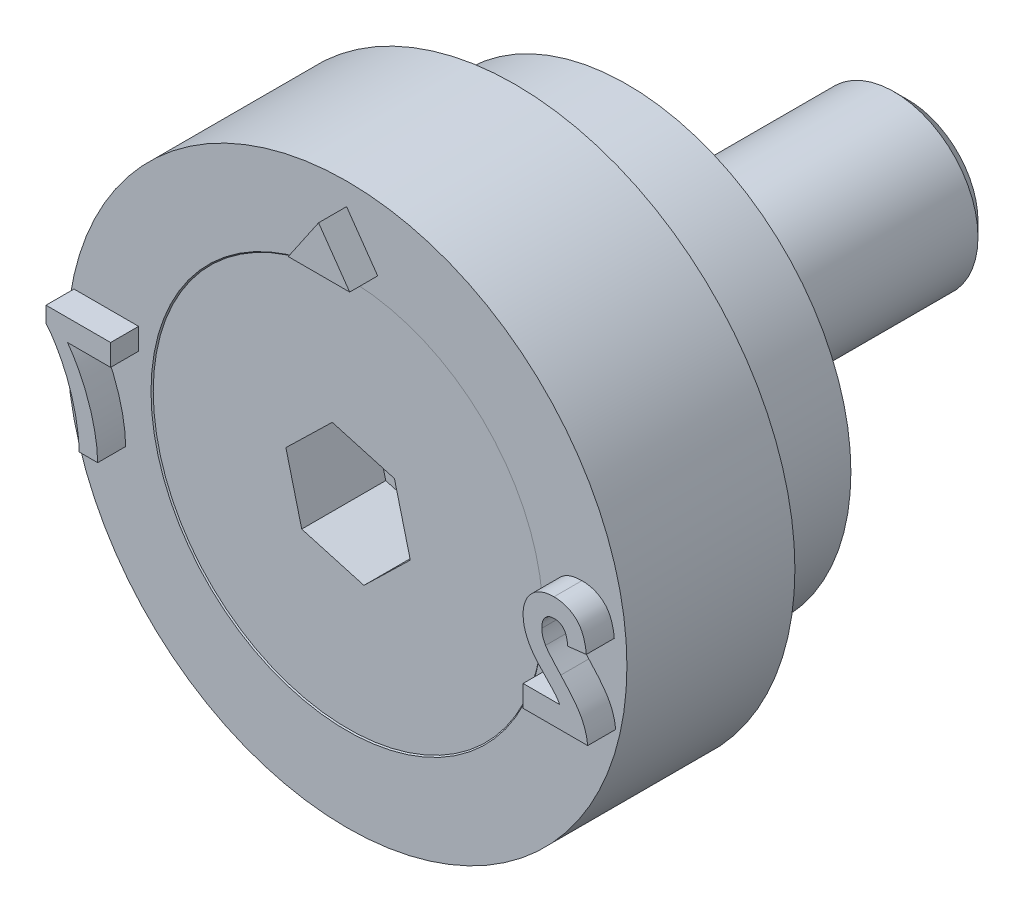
ISO-10303-21;
HEADER;
FILE_DESCRIPTION(('STEP AP214'),'2;1');
FILE_NAME('part.step','',(''),(''),'','','');
FILE_SCHEMA(('AUTOMOTIVE_DESIGN { 1 0 10303 214 1 1 1 1 }'));
ENDSEC;
DATA;
#1=APPLICATION_CONTEXT('core data for automotive mechanical design processes');
#2=APPLICATION_PROTOCOL_DEFINITION('international standard','automotive_design',2000,#1);
#3=PRODUCT_CONTEXT('',#1,'mechanical');
#4=PRODUCT('Part','Part','',(#3));
#5=PRODUCT_RELATED_PRODUCT_CATEGORY('part','',(#4));
#6=PRODUCT_DEFINITION_FORMATION('','',#4);
#7=PRODUCT_DEFINITION_CONTEXT('part definition',#1,'design');
#8=PRODUCT_DEFINITION('design','',#6,#7);
#9=PRODUCT_DEFINITION_SHAPE('','',#8);
#10=(LENGTH_UNIT() NAMED_UNIT(*) SI_UNIT(.MILLI.,.METRE.));
#11=(NAMED_UNIT(*) PLANE_ANGLE_UNIT() SI_UNIT($,.RADIAN.));
#12=(NAMED_UNIT(*) SI_UNIT($,.STERADIAN.) SOLID_ANGLE_UNIT());
#13=UNCERTAINTY_MEASURE_WITH_UNIT(LENGTH_MEASURE(1.E-05),#10,'distance_accuracy_value','');
#14=(GEOMETRIC_REPRESENTATION_CONTEXT(3) GLOBAL_UNCERTAINTY_ASSIGNED_CONTEXT((#13)) GLOBAL_UNIT_ASSIGNED_CONTEXT((#10,
#11,#12)) REPRESENTATION_CONTEXT('',''));
#15=CARTESIAN_POINT('',(0.,0.,0.));
#16=DIRECTION('',(0.,0.,1.));
#17=DIRECTION('',(1.,0.,0.));
#18=AXIS2_PLACEMENT_3D('',#15,#16,#17);
#19=CARTESIAN_POINT('',(0.,0.,-0.0200000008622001));
#20=DIRECTION('',(0.,0.,1.));
#21=DIRECTION('',(1.,0.,0.));
#22=AXIS2_PLACEMENT_3D('',#19,#20,#21);
#23=CYLINDRICAL_SURFACE('',#22,1.5);
#24=CARTESIAN_POINT('',(0.,0.,-2.0000000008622));
#25=DIRECTION('',(0.,0.,1.));
#26=DIRECTION('',(1.,0.,0.));
#27=AXIS2_PLACEMENT_3D('',#24,#25,#26);
#28=CIRCLE('',#27,1.5);
#29=CARTESIAN_POINT('',(1.5,0.,-2.0000000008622));
#30=VERTEX_POINT('',#29);
#31=EDGE_CURVE('E12',#30,#30,#28,.T.);
#32=ORIENTED_EDGE('',*,*,#31,.F.);
#33=EDGE_LOOP('',(#32));
#34=FACE_BOUND('',#33,.T.);
#35=CARTESIAN_POINT('',(0.,0.,-9.7700000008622));
#36=DIRECTION('',(0.,0.,1.));
#37=DIRECTION('',(1.,0.,0.));
#38=AXIS2_PLACEMENT_3D('',#35,#36,#37);
#39=CIRCLE('',#38,1.5);
#40=CARTESIAN_POINT('',(1.5,0.,-9.7700000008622));
#41=VERTEX_POINT('',#40);
#42=EDGE_CURVE('E152',#41,#41,#39,.T.);
#43=ORIENTED_EDGE('',*,*,#42,.T.);
#44=EDGE_LOOP('',(#43));
#45=FACE_BOUND('',#44,.T.);
#46=ADVANCED_FACE('F51',(#34,#45),#23,.T.);
#47=CARTESIAN_POINT('',(0.,0.,-2.0000000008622));
#48=DIRECTION('',(0.,0.,1.));
#49=DIRECTION('',(1.,0.,0.));
#50=AXIS2_PLACEMENT_3D('',#47,#48,#49);
#51=CONICAL_SURFACE('',#50,1.5,0.785398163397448);
#52=CARTESIAN_POINT('',(0.,0.,-0.0200000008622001));
#53=DIRECTION('',(0.,0.,1.));
#54=DIRECTION('',(1.,0.,0.));
#55=AXIS2_PLACEMENT_3D('',#52,#53,#54);
#56=CIRCLE('',#55,3.48);
#57=CARTESIAN_POINT('',(3.48,0.,-0.0200000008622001));
#58=VERTEX_POINT('',#57);
#59=EDGE_CURVE('E58',#58,#58,#56,.T.);
#60=ORIENTED_EDGE('',*,*,#59,.F.);
#61=EDGE_LOOP('',(#60));
#62=FACE_BOUND('',#61,.T.);
#63=ORIENTED_EDGE('',*,*,#31,.T.);
#64=EDGE_LOOP('',(#63));
#65=FACE_BOUND('',#64,.T.);
#66=ADVANCED_FACE('F167',(#62,#65),#51,.T.);
#67=CARTESIAN_POINT('',(0.,3.48,-0.0200000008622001));
#68=DIRECTION('',(0.,0.,-1.));
#69=DIRECTION('',(-1.,0.,0.));
#70=AXIS2_PLACEMENT_3D('',#67,#68,#69);
#71=PLANE('',#70);
#72=DIRECTION('',(0.962144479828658,-0.272539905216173,0.));
#73=VECTOR('',#72,1.);
#74=CARTESIAN_POINT('',(-0.828034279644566,-0.804793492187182,-0.0200000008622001));
#75=LINE('',#74,#73);
#76=CARTESIAN_POINT('',(-0.828034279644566,-0.804793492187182,-0.0200000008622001));
#77=VERTEX_POINT('',#76);
#78=CARTESIAN_POINT('',(0.282954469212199,-1.11949546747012,-0.0200000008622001));
#79=VERTEX_POINT('',#78);
#80=EDGE_CURVE('E139',#77,#79,#75,.T.);
#81=ORIENTED_EDGE('',*,*,#80,.F.);
#82=DIRECTION('',(0.245045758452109,-0.969511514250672,0.));
#83=VECTOR('',#82,1.);
#84=CARTESIAN_POINT('',(-1.11098874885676,0.314701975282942,-0.0200000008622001));
#85=LINE('',#84,#83);
#86=CARTESIAN_POINT('',(-1.11098874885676,0.314701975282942,-0.0200000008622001));
#87=VERTEX_POINT('',#86);
#88=EDGE_CURVE('E65',#87,#77,#85,.T.);
#89=ORIENTED_EDGE('',*,*,#88,.F.);
#90=DIRECTION('',(-0.717098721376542,-0.696971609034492,0.));
#91=VECTOR('',#90,1.);
#92=CARTESIAN_POINT('',(-0.282954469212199,1.11949546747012,-0.0200000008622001));
#93=LINE('',#92,#91);
#94=CARTESIAN_POINT('',(-0.282954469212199,1.11949546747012,-0.0200000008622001));
#95=VERTEX_POINT('',#94);
#96=EDGE_CURVE('E148',#95,#87,#93,.T.);
#97=ORIENTED_EDGE('',*,*,#96,.F.);
#98=DIRECTION('',(-0.962144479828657,0.272539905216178,0.));
#99=VECTOR('',#98,1.);
#100=CARTESIAN_POINT('',(0.828034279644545,0.804793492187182,-0.0200000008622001));
#101=LINE('',#100,#99);
#102=CARTESIAN_POINT('',(0.828034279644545,0.804793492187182,-0.0200000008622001));
#103=VERTEX_POINT('',#102);
#104=EDGE_CURVE('E146',#103,#95,#101,.T.);
#105=ORIENTED_EDGE('',*,*,#104,.F.);
#106=DIRECTION('',(-0.245045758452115,0.96951151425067,0.));
#107=VECTOR('',#106,1.);
#108=CARTESIAN_POINT('',(1.11098874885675,-0.314701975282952,-0.0200000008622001));
#109=LINE('',#108,#107);
#110=CARTESIAN_POINT('',(1.11098874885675,-0.314701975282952,-0.0200000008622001));
#111=VERTEX_POINT('',#110);
#112=EDGE_CURVE('E113',#111,#103,#109,.T.);
#113=ORIENTED_EDGE('',*,*,#112,.F.);
#114=DIRECTION('',(0.717098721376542,0.696971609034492,0.));
#115=VECTOR('',#114,1.);
#116=CARTESIAN_POINT('',(0.282954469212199,-1.11949546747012,-0.0200000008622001));
#117=LINE('',#116,#115);
#118=EDGE_CURVE('E142',#79,#111,#117,.T.);
#119=ORIENTED_EDGE('',*,*,#118,.F.);
#120=EDGE_LOOP('',(#81,#89,#97,#105,#113,#119));
#121=FACE_BOUND('',#120,.T.);
#122=ORIENTED_EDGE('',*,*,#59,.T.);
#123=EDGE_LOOP('',(#122));
#124=FACE_BOUND('',#123,.T.);
#125=ADVANCED_FACE('F165',(#121,#124),#71,.F.);
#126=CARTESIAN_POINT('',(0.,0.,-10.0200000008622));
#127=DIRECTION('',(0.,0.,1.));
#128=DIRECTION('',(1.,0.,0.));
#129=AXIS2_PLACEMENT_3D('',#126,#127,#128);
#130=PLANE('',#129);
#131=CARTESIAN_POINT('',(0.,0.,-10.0200000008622));
#132=DIRECTION('',(0.,0.,1.));
#133=DIRECTION('',(1.,0.,0.));
#134=AXIS2_PLACEMENT_3D('',#131,#132,#133);
#135=CIRCLE('',#134,1.25);
#136=CARTESIAN_POINT('',(1.25,0.,-10.0200000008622));
#137=VERTEX_POINT('',#136);
#138=EDGE_CURVE('E160',#137,#137,#135,.T.);
#139=ORIENTED_EDGE('',*,*,#138,.F.);
#140=EDGE_LOOP('',(#139));
#141=FACE_BOUND('',#140,.T.);
#142=ADVANCED_FACE('F180',(#141),#130,.F.);
#143=CARTESIAN_POINT('',(0.,0.,-10.0200000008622));
#144=DIRECTION('',(0.,0.,1.));
#145=DIRECTION('',(1.,0.,0.));
#146=AXIS2_PLACEMENT_3D('',#143,#144,#145);
#147=CONICAL_SURFACE('',#146,1.25,0.78539816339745);
#148=ORIENTED_EDGE('',*,*,#42,.F.);
#149=EDGE_LOOP('',(#148));
#150=FACE_BOUND('',#149,.T.);
#151=ORIENTED_EDGE('',*,*,#138,.T.);
#152=EDGE_LOOP('',(#151));
#153=FACE_BOUND('',#152,.T.);
#154=ADVANCED_FACE('F176',(#150,#153),#147,.T.);
#155=CARTESIAN_POINT('',(-1.11098874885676,0.314701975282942,-1.5200000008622));
#156=DIRECTION('',(-0.969511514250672,-0.245045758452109,0.));
#157=DIRECTION('',(0.245045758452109,-0.969511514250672,0.));
#158=AXIS2_PLACEMENT_3D('',#155,#156,#157);
#159=PLANE('',#158);
#160=ORIENTED_EDGE('',*,*,#88,.T.);
#161=DIRECTION('',(0.,0.,1.));
#162=VECTOR('',#161,1.);
#163=CARTESIAN_POINT('',(-0.828034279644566,-0.804793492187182,-1.5200000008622));
#164=LINE('',#163,#162);
#165=CARTESIAN_POINT('',(-0.828034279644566,-0.804793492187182,-1.5200000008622));
#166=VERTEX_POINT('',#165);
#167=EDGE_CURVE('E95',#166,#77,#164,.T.);
#168=ORIENTED_EDGE('',*,*,#167,.F.);
#169=DIRECTION('',(0.245045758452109,-0.969511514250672,0.));
#170=VECTOR('',#169,1.);
#171=CARTESIAN_POINT('',(-1.11098874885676,0.314701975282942,-1.5200000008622));
#172=LINE('',#171,#170);
#173=CARTESIAN_POINT('',(-1.11098874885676,0.314701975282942,-1.5200000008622));
#174=VERTEX_POINT('',#173);
#175=EDGE_CURVE('E150',#174,#166,#172,.T.);
#176=ORIENTED_EDGE('',*,*,#175,.F.);
#177=DIRECTION('',(0.,0.,1.));
#178=VECTOR('',#177,1.);
#179=CARTESIAN_POINT('',(-1.11098874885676,0.314701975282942,-1.5200000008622));
#180=LINE('',#179,#178);
#181=EDGE_CURVE('E73',#174,#87,#180,.T.);
#182=ORIENTED_EDGE('',*,*,#181,.T.);
#183=EDGE_LOOP('',(#160,#168,#176,#182));
#184=FACE_BOUND('',#183,.T.);
#185=ADVANCED_FACE('F179',(#184),#159,.F.);
#186=CARTESIAN_POINT('',(-0.282954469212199,1.11949546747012,-1.5200000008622));
#187=DIRECTION('',(-0.696971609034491,0.717098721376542,0.));
#188=DIRECTION('',(-0.717098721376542,-0.696971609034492,0.));
#189=AXIS2_PLACEMENT_3D('',#186,#187,#188);
#190=PLANE('',#189);
#191=ORIENTED_EDGE('',*,*,#96,.T.);
#192=ORIENTED_EDGE('',*,*,#181,.F.);
#193=DIRECTION('',(-0.717098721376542,-0.696971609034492,0.));
#194=VECTOR('',#193,1.);
#195=CARTESIAN_POINT('',(-0.282954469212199,1.11949546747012,-1.5200000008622));
#196=LINE('',#195,#194);
#197=CARTESIAN_POINT('',(-0.282954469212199,1.11949546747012,-1.5200000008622));
#198=VERTEX_POINT('',#197);
#199=EDGE_CURVE('E125',#198,#174,#196,.T.);
#200=ORIENTED_EDGE('',*,*,#199,.F.);
#201=DIRECTION('',(0.,0.,1.));
#202=VECTOR('',#201,1.);
#203=CARTESIAN_POINT('',(-0.282954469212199,1.11949546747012,-1.5200000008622));
#204=LINE('',#203,#202);
#205=EDGE_CURVE('E117',#198,#95,#204,.T.);
#206=ORIENTED_EDGE('',*,*,#205,.T.);
#207=EDGE_LOOP('',(#191,#192,#200,#206));
#208=FACE_BOUND('',#207,.T.);
#209=ADVANCED_FACE('F194',(#208),#190,.F.);
#210=CARTESIAN_POINT('',(0.828034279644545,0.804793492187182,-1.5200000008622));
#211=DIRECTION('',(0.272539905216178,0.962144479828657,0.));
#212=DIRECTION('',(-0.962144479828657,0.272539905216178,0.));
#213=AXIS2_PLACEMENT_3D('',#210,#211,#212);
#214=PLANE('',#213);
#215=ORIENTED_EDGE('',*,*,#104,.T.);
#216=ORIENTED_EDGE('',*,*,#205,.F.);
#217=DIRECTION('',(-0.962144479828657,0.272539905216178,0.));
#218=VECTOR('',#217,1.);
#219=CARTESIAN_POINT('',(0.828034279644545,0.804793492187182,-1.5200000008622));
#220=LINE('',#219,#218);
#221=CARTESIAN_POINT('',(0.828034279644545,0.804793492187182,-1.5200000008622));
#222=VERTEX_POINT('',#221);
#223=EDGE_CURVE('E121',#222,#198,#220,.T.);
#224=ORIENTED_EDGE('',*,*,#223,.F.);
#225=DIRECTION('',(0.,0.,1.));
#226=VECTOR('',#225,1.);
#227=CARTESIAN_POINT('',(0.828034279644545,0.804793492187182,-1.5200000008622));
#228=LINE('',#227,#226);
#229=EDGE_CURVE('E106',#222,#103,#228,.T.);
#230=ORIENTED_EDGE('',*,*,#229,.T.);
#231=EDGE_LOOP('',(#215,#216,#224,#230));
#232=FACE_BOUND('',#231,.T.);
#233=ADVANCED_FACE('F122',(#232),#214,.F.);
#234=CARTESIAN_POINT('',(1.11098874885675,-0.314701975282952,-1.5200000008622));
#235=DIRECTION('',(0.96951151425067,0.245045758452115,0.));
#236=DIRECTION('',(-0.245045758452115,0.96951151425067,0.));
#237=AXIS2_PLACEMENT_3D('',#234,#235,#236);
#238=PLANE('',#237);
#239=ORIENTED_EDGE('',*,*,#112,.T.);
#240=ORIENTED_EDGE('',*,*,#229,.F.);
#241=DIRECTION('',(-0.245045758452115,0.96951151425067,0.));
#242=VECTOR('',#241,1.);
#243=CARTESIAN_POINT('',(1.11098874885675,-0.314701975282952,-1.5200000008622));
#244=LINE('',#243,#242);
#245=CARTESIAN_POINT('',(1.11098874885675,-0.314701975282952,-1.5200000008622));
#246=VERTEX_POINT('',#245);
#247=EDGE_CURVE('E110',#246,#222,#244,.T.);
#248=ORIENTED_EDGE('',*,*,#247,.F.);
#249=DIRECTION('',(0.,0.,1.));
#250=VECTOR('',#249,1.);
#251=CARTESIAN_POINT('',(1.11098874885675,-0.314701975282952,-1.5200000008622));
#252=LINE('',#251,#250);
#253=EDGE_CURVE('E118',#246,#111,#252,.T.);
#254=ORIENTED_EDGE('',*,*,#253,.T.);
#255=EDGE_LOOP('',(#239,#240,#248,#254));
#256=FACE_BOUND('',#255,.T.);
#257=ADVANCED_FACE('F108',(#256),#238,.F.);
#258=CARTESIAN_POINT('',(0.282954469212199,-1.11949546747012,-1.5200000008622));
#259=DIRECTION('',(0.696971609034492,-0.717098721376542,0.));
#260=DIRECTION('',(0.717098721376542,0.696971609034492,0.));
#261=AXIS2_PLACEMENT_3D('',#258,#259,#260);
#262=PLANE('',#261);
#263=ORIENTED_EDGE('',*,*,#118,.T.);
#264=ORIENTED_EDGE('',*,*,#253,.F.);
#265=DIRECTION('',(0.717098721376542,0.696971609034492,0.));
#266=VECTOR('',#265,1.);
#267=CARTESIAN_POINT('',(0.282954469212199,-1.11949546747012,-1.5200000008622));
#268=LINE('',#267,#266);
#269=CARTESIAN_POINT('',(0.282954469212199,-1.11949546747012,-1.5200000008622));
#270=VERTEX_POINT('',#269);
#271=EDGE_CURVE('E131',#270,#246,#268,.T.);
#272=ORIENTED_EDGE('',*,*,#271,.F.);
#273=DIRECTION('',(0.,0.,1.));
#274=VECTOR('',#273,1.);
#275=CARTESIAN_POINT('',(0.282954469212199,-1.11949546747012,-1.5200000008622));
#276=LINE('',#275,#274);
#277=EDGE_CURVE('E155',#270,#79,#276,.T.);
#278=ORIENTED_EDGE('',*,*,#277,.T.);
#279=EDGE_LOOP('',(#263,#264,#272,#278));
#280=FACE_BOUND('',#279,.T.);
#281=ADVANCED_FACE('F198',(#280),#262,.F.);
#282=CARTESIAN_POINT('',(-0.828034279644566,-0.804793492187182,-1.5200000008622));
#283=DIRECTION('',(-0.272539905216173,-0.962144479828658,0.));
#284=DIRECTION('',(0.962144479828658,-0.272539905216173,0.));
#285=AXIS2_PLACEMENT_3D('',#282,#283,#284);
#286=PLANE('',#285);
#287=ORIENTED_EDGE('',*,*,#80,.T.);
#288=ORIENTED_EDGE('',*,*,#277,.F.);
#289=DIRECTION('',(0.962144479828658,-0.272539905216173,0.));
#290=VECTOR('',#289,1.);
#291=CARTESIAN_POINT('',(-0.828034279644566,-0.804793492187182,-1.5200000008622));
#292=LINE('',#291,#290);
#293=EDGE_CURVE('E133',#166,#270,#292,.T.);
#294=ORIENTED_EDGE('',*,*,#293,.F.);
#295=ORIENTED_EDGE('',*,*,#167,.T.);
#296=EDGE_LOOP('',(#287,#288,#294,#295));
#297=FACE_BOUND('',#296,.T.);
#298=ADVANCED_FACE('F195',(#297),#286,.F.);
#299=CARTESIAN_POINT('',(0.,0.,-1.5200000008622));
#300=DIRECTION('',(0.,0.,1.));
#301=DIRECTION('',(1.,0.,0.));
#302=AXIS2_PLACEMENT_3D('',#299,#300,#301);
#303=PLANE('',#302);
#304=ORIENTED_EDGE('',*,*,#175,.T.);
#305=ORIENTED_EDGE('',*,*,#293,.T.);
#306=ORIENTED_EDGE('',*,*,#271,.T.);
#307=ORIENTED_EDGE('',*,*,#247,.T.);
#308=ORIENTED_EDGE('',*,*,#223,.T.);
#309=ORIENTED_EDGE('',*,*,#199,.T.);
#310=EDGE_LOOP('',(#304,#305,#306,#307,#308,#309));
#311=FACE_BOUND('',#310,.T.);
#312=ADVANCED_FACE('F128',(#311),#303,.T.);
#313=CLOSED_SHELL('',(#46,#66,#125,#142,#154,#185,#209,#233,#257,#281,#298,#312));
#314=MANIFOLD_SOLID_BREP('B2',#313);
#315=CARTESIAN_POINT('',(0.,5.,0.));
#316=DIRECTION('',(0.,0.,-1.));
#317=DIRECTION('',(-1.,0.,0.));
#318=AXIS2_PLACEMENT_3D('',#315,#316,#317);
#319=PLANE('',#318);
#320=DIRECTION('',(1.,0.,0.));
#321=VECTOR('',#320,1.);
#322=CARTESIAN_POINT('',(-4.49021987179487,0.51024358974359,0.));
#323=LINE('',#322,#321);
#324=CARTESIAN_POINT('',(-4.49021987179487,0.51024358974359,0.));
#325=VERTEX_POINT('',#324);
#326=CARTESIAN_POINT('',(-3.72138974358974,0.51024358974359,0.));
#327=VERTEX_POINT('',#326);
#328=EDGE_CURVE('E484',#325,#327,#323,.T.);
#329=ORIENTED_EDGE('',*,*,#328,.F.);
#330=CARTESIAN_POINT('',(-3.95215897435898,-1.0795,0.));
#331=CARTESIAN_POINT('',(-3.95334914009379,-1.04542999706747,0.));
#332=CARTESIAN_POINT('',(-3.9557416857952,-0.976940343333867,0.));
#333=CARTESIAN_POINT('',(-3.96442753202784,-0.874179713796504,0.));
#334=CARTESIAN_POINT('',(-3.97660680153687,-0.770798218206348,0.));
#335=CARTESIAN_POINT('',(-3.99410732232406,-0.667159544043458,0.));
#336=CARTESIAN_POINT('',(-4.01539724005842,-0.562810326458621,0.));
#337=CARTESIAN_POINT('',(-4.04046319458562,-0.457955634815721,0.));
#338=CARTESIAN_POINT('',(-4.07032881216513,-0.352698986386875,0.));
#339=CARTESIAN_POINT('',(-4.10419858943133,-0.247553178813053,0.));
#340=CARTESIAN_POINT('',(-4.14174000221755,-0.143509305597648,0.));
#341=CARTESIAN_POINT('',(-4.18211393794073,-0.0415867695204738,0.));
#342=CARTESIAN_POINT('',(-4.22579908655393,0.057452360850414,0.));
#343=CARTESIAN_POINT('',(-4.27274329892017,0.153586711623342,0.));
#344=CARTESIAN_POINT('',(-4.3224219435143,0.247013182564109,0.));
#345=CARTESIAN_POINT('',(-4.37493575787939,0.33769994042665,0.));
#346=CARTESIAN_POINT('',(-4.43048387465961,0.425650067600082,0.));
#347=CARTESIAN_POINT('',(-4.47034405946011,0.482096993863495,0.));
#348=CARTESIAN_POINT('',(-4.49021987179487,0.51024358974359,0.));
#349=B_SPLINE_CURVE_WITH_KNOTS('',3,(#330,#331,#332,#333,#334,#335,#336,#337,#338,#339,#340,
#341,#342,#343,#344,#345,#346,#347,#348),.UNSPECIFIED.,.F.,.F.,(4,1,1,1,1,1,1,1,1,1,1,1,1,1,1,1,
4),(0.,0.0600673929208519,0.120751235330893,0.181671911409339,0.24345918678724,
0.305905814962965,0.369322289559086,0.433393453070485,0.498664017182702,0.563949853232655,
0.628278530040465,0.691815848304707,0.754651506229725,0.816767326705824,0.878243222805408,
0.939287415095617,1.),.UNSPECIFIED.);
#350=CARTESIAN_POINT('',(-3.95215897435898,-1.0795,0.));
#351=VERTEX_POINT('',#350);
#352=EDGE_CURVE('E497',#351,#325,#349,.T.);
#353=ORIENTED_EDGE('',*,*,#352,.F.);
#354=DIRECTION('',(1.,0.,0.));
#355=VECTOR('',#354,1.);
#356=CARTESIAN_POINT('',(-4.28549230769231,-1.0795,0.));
#357=LINE('',#356,#355);
#358=CARTESIAN_POINT('',(-4.28549230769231,-1.0795,0.));
#359=VERTEX_POINT('',#358);
#360=EDGE_CURVE('E754',#359,#351,#357,.T.);
#361=ORIENTED_EDGE('',*,*,#360,.F.);
#362=CARTESIAN_POINT('',(-4.8752358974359,0.612807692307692,0.));
#363=CARTESIAN_POINT('',(-4.86319357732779,0.59891270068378,0.));
#364=CARTESIAN_POINT('',(-4.83835965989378,0.570258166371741,0.));
#365=CARTESIAN_POINT('',(-4.80306738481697,0.523459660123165,0.));
#366=CARTESIAN_POINT('',(-4.76664303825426,0.473017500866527,0.));
#367=CARTESIAN_POINT('',(-4.7309985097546,0.417584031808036,0.));
#368=CARTESIAN_POINT('',(-4.69433811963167,0.358334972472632,0.));
#369=CARTESIAN_POINT('',(-4.657948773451,0.294548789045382,0.));
#370=CARTESIAN_POINT('',(-4.62159169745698,0.226289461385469,0.));
#371=CARTESIAN_POINT('',(-4.57234988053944,0.129735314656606,0.));
#372=CARTESIAN_POINT('',(-4.51441713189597,0.00389054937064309,0.));
#373=CARTESIAN_POINT('',(-4.45466802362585,-0.152947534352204,0.));
#374=CARTESIAN_POINT('',(-4.40218239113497,-0.313893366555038,0.));
#375=CARTESIAN_POINT('',(-4.36695342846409,-0.45122922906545,0.));
#376=CARTESIAN_POINT('',(-4.3430731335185,-0.561283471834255,0.));
#377=CARTESIAN_POINT('',(-4.32745471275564,-0.641832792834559,0.));
#378=CARTESIAN_POINT('',(-4.31395694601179,-0.720058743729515,0.));
#379=CARTESIAN_POINT('',(-4.30384988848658,-0.796286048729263,0.));
#380=CARTESIAN_POINT('',(-4.29503631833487,-0.870231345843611,0.));
#381=CARTESIAN_POINT('',(-4.28979681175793,-0.94202749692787,0.));
#382=CARTESIAN_POINT('',(-4.28566819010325,-1.01147646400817,0.));
#383=CARTESIAN_POINT('',(-4.28555033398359,-1.0570579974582,0.));
#384=CARTESIAN_POINT('',(-4.28549230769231,-1.0795,0.));
#385=B_SPLINE_CURVE_WITH_KNOTS('',3,(#362,#363,#364,#365,#366,#367,#368,#369,#370,#371,#372,
#373,#374,#375,#376,#377,#378,#379,#380,#381,#382,#383,#384),.UNSPECIFIED.,.F.,.F.,(4,1,1,1,1,1,
1,1,1,1,1,1,1,1,1,1,1,1,1,1,4),(0.,0.0302379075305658,0.0623572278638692,0.0963730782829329,
0.132566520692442,0.170733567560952,0.210979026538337,0.253338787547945,0.29794273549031,
0.389265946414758,0.481060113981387,0.573874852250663,0.667598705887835,0.714134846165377,
0.759114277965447,0.802561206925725,0.844689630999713,0.885591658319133,0.92503468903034,
0.963090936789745,1.),.UNSPECIFIED.);
#386=CARTESIAN_POINT('',(-4.8752358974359,0.612807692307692,0.));
#387=VERTEX_POINT('',#386);
#388=EDGE_CURVE('E749',#387,#359,#385,.T.);
#389=ORIENTED_EDGE('',*,*,#388,.F.);
#390=DIRECTION('',(0.,-1.,0.));
#391=VECTOR('',#390,1.);
#392=CARTESIAN_POINT('',(-4.8752358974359,0.894858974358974,0.));
#393=LINE('',#392,#391);
#394=CARTESIAN_POINT('',(-4.8752358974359,0.894858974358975,0.));
#395=VERTEX_POINT('',#394);
#396=EDGE_CURVE('E746',#395,#387,#393,.T.);
#397=ORIENTED_EDGE('',*,*,#396,.F.);
#398=DIRECTION('',(-1.,0.,0.));
#399=VECTOR('',#398,1.);
#400=CARTESIAN_POINT('',(-3.72138974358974,0.894858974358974,0.));
#401=LINE('',#400,#399);
#402=CARTESIAN_POINT('',(-3.72138974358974,0.894858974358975,0.));
#403=VERTEX_POINT('',#402);
#404=EDGE_CURVE('E743',#403,#395,#401,.T.);
#405=ORIENTED_EDGE('',*,*,#404,.F.);
#406=DIRECTION('',(0.,1.,0.));
#407=VECTOR('',#406,1.);
#408=CARTESIAN_POINT('',(-3.72138974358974,0.51024358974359,0.));
#409=LINE('',#408,#407);
#410=EDGE_CURVE('E487',#327,#403,#409,.T.);
#411=ORIENTED_EDGE('',*,*,#410,.F.);
#412=EDGE_LOOP('',(#329,#353,#361,#389,#397,#405,#411));
#413=FACE_BOUND('',#412,.T.);
#414=CARTESIAN_POINT('',(0.,0.,0.));
#415=DIRECTION('',(0.,0.,1.));
#416=DIRECTION('',(1.,0.,0.));
#417=AXIS2_PLACEMENT_3D('',#414,#415,#416);
#418=CIRCLE('',#417,5.);
#419=CARTESIAN_POINT('',(5.,0.,0.));
#420=VERTEX_POINT('',#419);
#421=EDGE_CURVE('E49',#420,#420,#418,.T.);
#422=ORIENTED_EDGE('',*,*,#421,.T.);
#423=EDGE_LOOP('',(#422));
#424=FACE_BOUND('',#423,.T.);
#425=CARTESIAN_POINT('',(0.,0.,0.));
#426=DIRECTION('',(0.,0.,1.));
#427=DIRECTION('',(1.,0.,0.));
#428=AXIS2_PLACEMENT_3D('',#425,#426,#427);
#429=CIRCLE('',#428,3.5000000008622);
#430=CARTESIAN_POINT('',(3.5000000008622,0.,0.));
#431=VERTEX_POINT('',#430);
#432=EDGE_CURVE('E319',#431,#431,#429,.T.);
#433=ORIENTED_EDGE('',*,*,#432,.F.);
#434=EDGE_LOOP('',(#433));
#435=FACE_BOUND('',#434,.T.);
#436=DIRECTION('',(-1.,0.,0.));
#437=VECTOR('',#436,1.);
#438=CARTESIAN_POINT('',(4.29923525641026,-0.694884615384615,0.));
#439=LINE('',#438,#437);
#440=CARTESIAN_POINT('',(4.29923525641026,-0.694884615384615,0.));
#441=VERTEX_POINT('',#440);
#442=CARTESIAN_POINT('',(3.64578974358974,-0.694884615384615,0.));
#443=VERTEX_POINT('',#442);
#444=EDGE_CURVE('E560',#441,#443,#439,.T.);
#445=ORIENTED_EDGE('',*,*,#444,.F.);
#446=CARTESIAN_POINT('',(3.81566153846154,-0.125173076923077,0.));
#447=CARTESIAN_POINT('',(3.82091886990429,-0.132847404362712,0.));
#448=CARTESIAN_POINT('',(3.83220192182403,-0.149317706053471,0.));
#449=CARTESIAN_POINT('',(3.85205715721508,-0.17421227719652,0.));
#450=CARTESIAN_POINT('',(3.8744361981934,-0.202014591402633,0.));
#451=CARTESIAN_POINT('',(3.90014076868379,-0.232028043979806,0.));
#452=CARTESIAN_POINT('',(3.92905633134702,-0.264301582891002,0.));
#453=CARTESIAN_POINT('',(3.96053053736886,-0.299443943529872,0.));
#454=CARTESIAN_POINT('',(3.99616295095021,-0.33596917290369,0.));
#455=CARTESIAN_POINT('',(4.03290284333,-0.374801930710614,0.));
#456=CARTESIAN_POINT('',(4.07025825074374,-0.412253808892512,0.));
#457=CARTESIAN_POINT('',(4.1041164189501,-0.448096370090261,0.));
#458=CARTESIAN_POINT('',(4.13475565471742,-0.480101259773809,0.));
#459=CARTESIAN_POINT('',(4.16148576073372,-0.508922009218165,0.));
#460=CARTESIAN_POINT('',(4.18469884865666,-0.534183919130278,0.));
#461=CARTESIAN_POINT('',(4.20450316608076,-0.555682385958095,0.));
#462=CARTESIAN_POINT('',(4.22021600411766,-0.574175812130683,0.));
#463=CARTESIAN_POINT('',(4.24238770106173,-0.602402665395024,0.));
#464=CARTESIAN_POINT('',(4.27029425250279,-0.641165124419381,0.));
#465=CARTESIAN_POINT('',(4.28983877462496,-0.677443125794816,0.));
#466=CARTESIAN_POINT('',(4.29923525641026,-0.694884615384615,0.));
#467=B_SPLINE_CURVE_WITH_KNOTS('',3,(#446,#447,#448,#449,#450,#451,#452,#453,#454,#455,#456,
#457,#458,#459,#460,#461,#462,#463,#464,#465,#466),.UNSPECIFIED.,.F.,.F.,(4,1,1,1,1,1,1,1,1,1,1,
1,1,1,1,1,1,1,4),(0.,0.0372293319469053,0.079899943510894,0.127410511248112,0.180123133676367,
0.238064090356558,0.30089248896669,0.368957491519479,0.442313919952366,0.514902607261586,
0.580699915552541,0.639694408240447,0.692276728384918,0.73805927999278,0.777043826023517,
0.809286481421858,0.835170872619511,0.920754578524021,1.),.UNSPECIFIED.);
#468=CARTESIAN_POINT('',(3.81566153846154,-0.125173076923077,0.));
#469=VERTEX_POINT('',#468);
#470=EDGE_CURVE('E637',#469,#441,#467,.T.);
#471=ORIENTED_EDGE('',*,*,#470,.F.);
#472=CARTESIAN_POINT('',(3.64578974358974,0.376429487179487,0.));
#473=CARTESIAN_POINT('',(3.64621245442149,0.354638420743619,0.));
#474=CARTESIAN_POINT('',(3.64705015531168,0.311454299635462,0.));
#475=CARTESIAN_POINT('',(3.65494215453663,0.247527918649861,0.));
#476=CARTESIAN_POINT('',(3.66766685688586,0.185179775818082,0.));
#477=CARTESIAN_POINT('',(3.68609868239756,0.124042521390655,0.));
#478=CARTESIAN_POINT('',(3.70952430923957,0.0629087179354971,0.));
#479=CARTESIAN_POINT('',(3.7391619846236,0.00107661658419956,0.));
#480=CARTESIAN_POINT('',(3.77429810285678,-0.0623403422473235,0.));
#481=CARTESIAN_POINT('',(3.80162214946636,-0.103846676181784,0.));
#482=CARTESIAN_POINT('',(3.81566153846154,-0.125173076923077,0.));
#483=B_SPLINE_CURVE_WITH_KNOTS('',3,(#472,#473,#474,#475,#476,#477,#478,#479,#480,#481,#482),
.UNSPECIFIED.,.F.,.F.,(4,1,1,1,1,1,1,1,4),(0.,0.121430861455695,0.240643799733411,
0.358470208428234,0.475770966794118,0.596193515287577,0.723070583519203,0.85771068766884,1.),.UNSPECIFIED.);
#484=CARTESIAN_POINT('',(3.64578974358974,0.376429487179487,0.));
#485=VERTEX_POINT('',#484);
#486=EDGE_CURVE('E629',#485,#469,#483,.T.);
#487=ORIENTED_EDGE('',*,*,#486,.F.);
#488=CARTESIAN_POINT('',(4.19667115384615,0.9205,0.));
#489=CARTESIAN_POINT('',(4.17581907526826,0.920051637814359,0.));
#490=CARTESIAN_POINT('',(4.13518578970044,0.919177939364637,0.));
#491=CARTESIAN_POINT('',(4.07584387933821,0.911992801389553,0.));
#492=CARTESIAN_POINT('',(4.02003299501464,0.899340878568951,0.));
#493=CARTESIAN_POINT('',(3.96726601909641,0.882960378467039,0.));
#494=CARTESIAN_POINT('',(3.91839562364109,0.860482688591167,0.));
#495=CARTESIAN_POINT('',(3.87268241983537,0.833610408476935,0.));
#496=CARTESIAN_POINT('',(3.8306551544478,0.8013846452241,0.));
#497=CARTESIAN_POINT('',(3.7921920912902,0.76491912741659,0.));
#498=CARTESIAN_POINT('',(3.75792408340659,0.724880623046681,0.));
#499=CARTESIAN_POINT('',(3.72764558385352,0.682365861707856,0.));
#500=CARTESIAN_POINT('',(3.70225492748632,0.637244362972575,0.));
#501=CARTESIAN_POINT('',(3.68180020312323,0.589637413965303,0.));
#502=CARTESIAN_POINT('',(3.66574316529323,0.53972788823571,0.));
#503=CARTESIAN_POINT('',(3.65406868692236,0.48745142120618,0.));
#504=CARTESIAN_POINT('',(3.64722057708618,0.432701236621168,0.));
#505=CARTESIAN_POINT('',(3.64627242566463,0.395412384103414,0.));
#506=CARTESIAN_POINT('',(3.64578974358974,0.376429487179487,0.));
#507=B_SPLINE_CURVE_WITH_KNOTS('',3,(#488,#489,#490,#491,#492,#493,#494,#495,#496,#497,#498,
#499,#500,#501,#502,#503,#504,#505,#506),.UNSPECIFIED.,.F.,.F.,(4,1,1,1,1,1,1,1,1,1,1,1,1,1,1,1,
4),(0.,0.0718026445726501,0.139917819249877,0.205419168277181,0.268691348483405,
0.329822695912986,0.390243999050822,0.450956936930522,0.511795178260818,0.572457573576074,
0.632179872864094,0.69128264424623,0.750406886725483,0.810332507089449,0.871593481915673,
0.934631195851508,1.),.UNSPECIFIED.);
#508=CARTESIAN_POINT('',(4.19667115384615,0.9205,0.));
#509=VERTEX_POINT('',#508);
#510=EDGE_CURVE('E621',#509,#485,#507,.T.);
#511=ORIENTED_EDGE('',*,*,#510,.F.);
#512=CARTESIAN_POINT('',(4.77399487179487,0.317134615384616,0.));
#513=CARTESIAN_POINT('',(4.77131775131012,0.343098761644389,0.));
#514=CARTESIAN_POINT('',(4.76613036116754,0.393408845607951,0.));
#515=CARTESIAN_POINT('',(4.75213725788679,0.465592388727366,0.));
#516=CARTESIAN_POINT('',(4.73533746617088,0.532301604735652,0.));
#517=CARTESIAN_POINT('',(4.7139375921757,0.593271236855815,0.));
#518=CARTESIAN_POINT('',(4.68897145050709,0.648742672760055,0.));
#519=CARTESIAN_POINT('',(4.65961943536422,0.698290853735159,0.));
#520=CARTESIAN_POINT('',(4.62648435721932,0.742308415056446,0.));
#521=CARTESIAN_POINT('',(4.58907375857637,0.780409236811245,0.));
#522=CARTESIAN_POINT('',(4.54814862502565,0.813171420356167,0.));
#523=CARTESIAN_POINT('',(4.5053864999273,0.842328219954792,0.));
#524=CARTESIAN_POINT('',(4.45974864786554,0.866424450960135,0.));
#525=CARTESIAN_POINT('',(4.41177480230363,0.885993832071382,0.));
#526=CARTESIAN_POINT('',(4.36161481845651,0.901930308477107,0.));
#527=CARTESIAN_POINT('',(4.30865203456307,0.912378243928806,0.));
#528=CARTESIAN_POINT('',(4.253495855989,0.919617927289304,0.));
#529=CARTESIAN_POINT('',(4.21579287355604,0.920203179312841,0.));
#530=CARTESIAN_POINT('',(4.19667115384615,0.9205,0.));
#531=B_SPLINE_CURVE_WITH_KNOTS('',3,(#512,#513,#514,#515,#516,#517,#518,#519,#520,#521,#522,
#523,#524,#525,#526,#527,#528,#529,#530),.UNSPECIFIED.,.F.,.F.,(4,1,1,1,1,1,1,1,1,1,1,1,1,1,1,1,
4),(0.,0.0836347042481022,0.16205689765,0.235468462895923,0.303979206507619,0.368923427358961,
0.430156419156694,0.488208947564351,0.545123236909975,0.60081849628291,0.65603122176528,
0.710804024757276,0.765898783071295,0.821956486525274,0.879217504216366,0.938743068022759,1.),.UNSPECIFIED.);
#532=CARTESIAN_POINT('',(4.77399487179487,0.317134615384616,0.));
#533=VERTEX_POINT('',#532);
#534=EDGE_CURVE('E616',#533,#509,#531,.T.);
#535=ORIENTED_EDGE('',*,*,#534,.F.);
#536=DIRECTION('',(0.993678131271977,0.112266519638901,0.));
#537=VECTOR('',#536,1.);
#538=CARTESIAN_POINT('',(4.44066153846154,0.279474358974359,0.));
#539=LINE('',#538,#537);
#540=CARTESIAN_POINT('',(4.44066153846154,0.279474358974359,0.));
#541=VERTEX_POINT('',#540);
#542=EDGE_CURVE('E610',#541,#533,#539,.T.);
#543=ORIENTED_EDGE('',*,*,#542,.F.);
#544=CARTESIAN_POINT('',(4.20388269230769,0.587166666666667,0.));
#545=CARTESIAN_POINT('',(4.22040159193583,0.586388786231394,0.));
#546=CARTESIAN_POINT('',(4.25228264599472,0.584887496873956,0.));
#547=CARTESIAN_POINT('',(4.29762478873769,0.571328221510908,0.));
#548=CARTESIAN_POINT('',(4.33735542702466,0.548245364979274,0.));
#549=CARTESIAN_POINT('',(4.36575604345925,0.522033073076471,0.));
#550=CARTESIAN_POINT('',(4.3848646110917,0.496493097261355,0.));
#551=CARTESIAN_POINT('',(4.3976765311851,0.474079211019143,0.));
#552=CARTESIAN_POINT('',(4.40934463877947,0.448970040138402,0.));
#553=CARTESIAN_POINT('',(4.41877140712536,0.420683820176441,0.));
#554=CARTESIAN_POINT('',(4.42683056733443,0.389634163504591,0.));
#555=CARTESIAN_POINT('',(4.43308114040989,0.355614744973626,0.));
#556=CARTESIAN_POINT('',(4.43795310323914,0.318574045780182,0.));
#557=CARTESIAN_POINT('',(4.43973552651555,0.292842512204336,0.));
#558=CARTESIAN_POINT('',(4.44066153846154,0.279474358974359,0.));
#559=B_SPLINE_CURVE_WITH_KNOTS('',3,(#544,#545,#546,#547,#548,#549,#550,#551,#552,#553,#554,
#555,#556,#557,#558),.UNSPECIFIED.,.F.,.F.,(4,1,1,1,1,1,1,1,1,1,1,1,4),(0.,0.113180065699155,
0.218434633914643,0.321087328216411,0.426146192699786,0.481136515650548,0.539455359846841,
0.603018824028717,0.670840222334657,0.743752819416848,0.823023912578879,0.908056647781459,1.),.UNSPECIFIED.);
#560=CARTESIAN_POINT('',(4.20388269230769,0.587166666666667,0.));
#561=VERTEX_POINT('',#560);
#562=EDGE_CURVE('E602',#561,#541,#559,.T.);
#563=ORIENTED_EDGE('',*,*,#562,.F.);
#564=CARTESIAN_POINT('',(3.97912307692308,0.324746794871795,0.));
#565=CARTESIAN_POINT('',(3.97969358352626,0.344703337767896,0.));
#566=CARTESIAN_POINT('',(3.98077233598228,0.382438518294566,0.));
#567=CARTESIAN_POINT('',(3.99200245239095,0.435521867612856,0.));
#568=CARTESIAN_POINT('',(4.01087480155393,0.481294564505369,0.));
#569=CARTESIAN_POINT('',(4.03708472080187,0.519910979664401,0.));
#570=CARTESIAN_POINT('',(4.07067009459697,0.54980786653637,0.));
#571=CARTESIAN_POINT('',(4.10967671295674,0.572501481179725,0.));
#572=CARTESIAN_POINT('',(4.1552446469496,0.584615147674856,0.));
#573=CARTESIAN_POINT('',(4.1872587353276,0.586294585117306,0.));
#574=CARTESIAN_POINT('',(4.20388269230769,0.587166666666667,0.));
#575=B_SPLINE_CURVE_WITH_KNOTS('',3,(#564,#565,#566,#567,#568,#569,#570,#571,#572,#573,#574),
.UNSPECIFIED.,.F.,.F.,(4,1,1,1,1,1,1,1,4),(0.,0.152713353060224,0.288760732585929,
0.413023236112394,0.52994305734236,0.642943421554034,0.754737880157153,0.872642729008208,1.),.UNSPECIFIED.);
#576=CARTESIAN_POINT('',(3.97912307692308,0.324746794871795,0.));
#577=VERTEX_POINT('',#576);
#578=EDGE_CURVE('E594',#577,#561,#575,.T.);
#579=ORIENTED_EDGE('',*,*,#578,.F.);
#580=CARTESIAN_POINT('',(4.04683141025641,0.0935769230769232,0.));
#581=CARTESIAN_POINT('',(4.03647064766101,0.112850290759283,0.));
#582=CARTESIAN_POINT('',(4.01639721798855,0.150191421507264,0.));
#583=CARTESIAN_POINT('',(3.99488777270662,0.208579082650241,0.));
#584=CARTESIAN_POINT('',(3.98195765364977,0.266752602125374,0.));
#585=CARTESIAN_POINT('',(3.98005949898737,0.30558801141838,0.));
#586=CARTESIAN_POINT('',(3.97912307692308,0.324746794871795,0.));
#587=B_SPLINE_CURVE_WITH_KNOTS('',3,(#580,#581,#582,#583,#584,#585,#586),.UNSPECIFIED.,.F.,.F.,
(4,1,1,1,4),(0.,0.269282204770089,0.52172003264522,0.764048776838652,1.),.UNSPECIFIED.);
#588=CARTESIAN_POINT('',(4.04683141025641,0.0935769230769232,0.));
#589=VERTEX_POINT('',#588);
#590=EDGE_CURVE('E586',#589,#577,#587,.T.);
#591=ORIENTED_EDGE('',*,*,#590,.F.);
#592=CARTESIAN_POINT('',(4.31886666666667,-0.229339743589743,0.));
#593=CARTESIAN_POINT('',(4.3012107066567,-0.210268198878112,0.));
#594=CARTESIAN_POINT('',(4.2676263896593,-0.173991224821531,0.));
#595=CARTESIAN_POINT('',(4.22007436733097,-0.121763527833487,0.));
#596=CARTESIAN_POINT('',(4.1780980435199,-0.0741321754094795,0.));
#597=CARTESIAN_POINT('',(4.14131111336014,-0.0314438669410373,0.));
#598=CARTESIAN_POINT('',(4.10976600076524,0.00636764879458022,0.));
#599=CARTESIAN_POINT('',(4.08375243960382,0.0394290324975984,0.));
#600=CARTESIAN_POINT('',(4.06304816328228,0.0678334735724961,0.));
#601=CARTESIAN_POINT('',(4.05182784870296,0.0856452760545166,0.));
#602=CARTESIAN_POINT('',(4.04683141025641,0.0935769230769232,0.));
#603=B_SPLINE_CURVE_WITH_KNOTS('',3,(#592,#593,#594,#595,#596,#597,#598,#599,#600,#601,#602),
.UNSPECIFIED.,.F.,.F.,(4,1,1,1,1,1,1,1,4),(0.,0.184436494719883,0.350826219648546,
0.50123098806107,0.634967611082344,0.750729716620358,0.850641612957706,0.933490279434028,1.),.UNSPECIFIED.);
#604=CARTESIAN_POINT('',(4.31886666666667,-0.229339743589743,0.));
#605=VERTEX_POINT('',#604);
#606=EDGE_CURVE('E578',#605,#589,#603,.T.);
#607=ORIENTED_EDGE('',*,*,#606,.F.);
#608=CARTESIAN_POINT('',(4.7996358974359,-1.0795,0.));
#609=CARTESIAN_POINT('',(4.79566653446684,-1.04665730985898,0.));
#610=CARTESIAN_POINT('',(4.78774886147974,-0.981146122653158,0.));
#611=CARTESIAN_POINT('',(4.76328976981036,-0.88523602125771,0.));
#612=CARTESIAN_POINT('',(4.73095650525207,-0.791575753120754,0.));
#613=CARTESIAN_POINT('',(4.69540984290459,-0.715449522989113,0.));
#614=CARTESIAN_POINT('',(4.66088844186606,-0.653533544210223,0.));
#615=CARTESIAN_POINT('',(4.62854439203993,-0.60362757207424,0.));
#616=CARTESIAN_POINT('',(4.59081496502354,-0.549939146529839,0.));
#617=CARTESIAN_POINT('',(4.54742576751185,-0.49268902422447,0.));
#618=CARTESIAN_POINT('',(4.49847546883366,-0.431813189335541,0.));
#619=CARTESIAN_POINT('',(4.44388626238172,-0.367368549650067,0.));
#620=CARTESIAN_POINT('',(4.38379499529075,-0.299105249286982,0.));
#621=CARTESIAN_POINT('',(4.34101685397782,-0.253140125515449,0.));
#622=CARTESIAN_POINT('',(4.31886666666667,-0.229339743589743,0.));
#623=B_SPLINE_CURVE_WITH_KNOTS('',3,(#608,#609,#610,#611,#612,#613,#614,#615,#616,#617,#618,
#619,#620,#621,#622),.UNSPECIFIED.,.F.,.F.,(4,1,1,1,1,1,1,1,1,1,1,1,4),(0.,0.0994452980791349,
0.198363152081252,0.297103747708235,0.397237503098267,0.450667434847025,0.510300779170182,
0.576071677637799,0.648078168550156,0.72639487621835,0.811079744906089,0.902178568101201,1.),.UNSPECIFIED.);
#624=CARTESIAN_POINT('',(4.7996358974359,-1.0795,0.));
#625=VERTEX_POINT('',#624);
#626=EDGE_CURVE('E573',#625,#605,#623,.T.);
#627=ORIENTED_EDGE('',*,*,#626,.F.);
#628=DIRECTION('',(1.,0.,0.));
#629=VECTOR('',#628,1.);
#630=CARTESIAN_POINT('',(3.64578974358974,-1.0795,0.));
#631=LINE('',#630,#629);
#632=CARTESIAN_POINT('',(3.64578974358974,-1.0795,0.));
#633=VERTEX_POINT('',#632);
#634=EDGE_CURVE('E570',#633,#625,#631,.T.);
#635=ORIENTED_EDGE('',*,*,#634,.F.);
#636=DIRECTION('',(0.,-1.,0.));
#637=VECTOR('',#636,1.);
#638=CARTESIAN_POINT('',(3.64578974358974,-0.694884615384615,0.));
#639=LINE('',#638,#637);
#640=EDGE_CURVE('E566',#443,#633,#639,.T.);
#641=ORIENTED_EDGE('',*,*,#640,.F.);
#642=EDGE_LOOP('',(#445,#471,#487,#511,#535,#543,#563,#579,#591,#607,#627,#635,#641));
#643=FACE_BOUND('',#642,.T.);
#644=DIRECTION('',(-0.573576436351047,0.819152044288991,0.));
#645=VECTOR('',#644,1.);
#646=CARTESIAN_POINT('',(0.548658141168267,3.81,0.));
#647=LINE('',#646,#645);
#648=CARTESIAN_POINT('',(0.548658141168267,3.81,0.));
#649=VERTEX_POINT('',#648);
#650=CARTESIAN_POINT('',(-0.00713159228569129,4.60375,0.));
#651=VERTEX_POINT('',#650);
#652=EDGE_CURVE('E483',#649,#651,#647,.T.);
#653=ORIENTED_EDGE('',*,*,#652,.F.);
#654=DIRECTION('',(1.,0.,0.));
#655=VECTOR('',#654,1.);
#656=CARTESIAN_POINT('',(-0.548658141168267,3.81,0.));
#657=LINE('',#656,#655);
#658=CARTESIAN_POINT('',(-0.548658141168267,3.81,0.));
#659=VERTEX_POINT('',#658);
#660=EDGE_CURVE('E330',#659,#649,#657,.T.);
#661=ORIENTED_EDGE('',*,*,#660,.F.);
#662=DIRECTION('',(-0.563573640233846,-0.826065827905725,0.));
#663=VECTOR('',#662,1.);
#664=CARTESIAN_POINT('',(-0.00713159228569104,4.60375,0.));
#665=LINE('',#664,#663);
#666=EDGE_CURVE('E326',#651,#659,#665,.T.);
#667=ORIENTED_EDGE('',*,*,#666,.F.);
#668=EDGE_LOOP('',(#653,#661,#667));
#669=FACE_BOUND('',#668,.T.);
#670=ADVANCED_FACE('F311',(#413,#424,#435,#643,#669),#319,.F.);
#671=CARTESIAN_POINT('',(0.,0.,3.12219627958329));
#672=DIRECTION('',(0.,0.,1.));
#673=DIRECTION('',(1.,0.,0.));
#674=AXIS2_PLACEMENT_3D('',#671,#672,#673);
#675=CYLINDRICAL_SURFACE('',#674,5.);
#676=ORIENTED_EDGE('',*,*,#421,.F.);
#677=EDGE_LOOP('',(#676));
#678=FACE_BOUND('',#677,.T.);
#679=CARTESIAN_POINT('',(0.,0.,-3.));
#680=DIRECTION('',(0.,0.,1.));
#681=DIRECTION('',(1.,0.,0.));
#682=AXIS2_PLACEMENT_3D('',#679,#680,#681);
#683=CIRCLE('',#682,5.);
#684=CARTESIAN_POINT('',(5.,0.,-3.));
#685=VERTEX_POINT('',#684);
#686=EDGE_CURVE('E687',#685,#685,#683,.T.);
#687=ORIENTED_EDGE('',*,*,#686,.T.);
#688=EDGE_LOOP('',(#687));
#689=FACE_BOUND('',#688,.T.);
#690=ADVANCED_FACE('F313',(#678,#689),#675,.T.);
#691=CARTESIAN_POINT('',(0.,0.,0.));
#692=DIRECTION('',(0.,0.,1.));
#693=DIRECTION('',(1.,0.,0.));
#694=AXIS2_PLACEMENT_3D('',#691,#692,#693);
#695=CONICAL_SURFACE('',#694,3.5000000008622,0.785398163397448);
#696=CARTESIAN_POINT('',(0.,0.,-2.0000000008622));
#697=DIRECTION('',(0.,0.,1.));
#698=DIRECTION('',(1.,0.,0.));
#699=AXIS2_PLACEMENT_3D('',#696,#697,#698);
#700=CIRCLE('',#699,1.5);
#701=CARTESIAN_POINT('',(1.5,0.,-2.0000000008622));
#702=VERTEX_POINT('',#701);
#703=EDGE_CURVE('E699',#702,#702,#700,.T.);
#704=ORIENTED_EDGE('',*,*,#703,.F.);
#705=EDGE_LOOP('',(#704));
#706=FACE_BOUND('',#705,.T.);
#707=ORIENTED_EDGE('',*,*,#432,.T.);
#708=EDGE_LOOP('',(#707));
#709=FACE_BOUND('',#708,.T.);
#710=ADVANCED_FACE('F704',(#706,#709),#695,.F.);
#711=CARTESIAN_POINT('',(0.,0.,3.12219627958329));
#712=DIRECTION('',(0.,0.,1.));
#713=DIRECTION('',(1.,0.,0.));
#714=AXIS2_PLACEMENT_3D('',#711,#712,#713);
#715=CYLINDRICAL_SURFACE('',#714,1.5);
#716=CARTESIAN_POINT('',(0.,0.,-5.));
#717=DIRECTION('',(0.,0.,1.));
#718=DIRECTION('',(1.,0.,0.));
#719=AXIS2_PLACEMENT_3D('',#716,#717,#718);
#720=CIRCLE('',#719,1.5);
#721=CARTESIAN_POINT('',(1.5,0.,-5.));
#722=VERTEX_POINT('',#721);
#723=EDGE_CURVE('E696',#722,#722,#720,.T.);
#724=ORIENTED_EDGE('',*,*,#723,.F.);
#725=EDGE_LOOP('',(#724));
#726=FACE_BOUND('',#725,.T.);
#727=ORIENTED_EDGE('',*,*,#703,.T.);
#728=EDGE_LOOP('',(#727));
#729=FACE_BOUND('',#728,.T.);
#730=ADVANCED_FACE('F836',(#726,#729),#715,.F.);
#731=CARTESIAN_POINT('',(0.,1.5,-5.));
#732=DIRECTION('',(0.,0.,1.));
#733=DIRECTION('',(1.,0.,0.));
#734=AXIS2_PLACEMENT_3D('',#731,#732,#733);
#735=PLANE('',#734);
#736=CARTESIAN_POINT('',(0.,0.,-5.));
#737=DIRECTION('',(0.,0.,1.));
#738=DIRECTION('',(1.,0.,0.));
#739=AXIS2_PLACEMENT_3D('',#736,#737,#738);
#740=CIRCLE('',#739,4.);
#741=CARTESIAN_POINT('',(4.,0.,-5.));
#742=VERTEX_POINT('',#741);
#743=EDGE_CURVE('E693',#742,#742,#740,.T.);
#744=ORIENTED_EDGE('',*,*,#743,.F.);
#745=EDGE_LOOP('',(#744));
#746=FACE_BOUND('',#745,.T.);
#747=ORIENTED_EDGE('',*,*,#723,.T.);
#748=EDGE_LOOP('',(#747));
#749=FACE_BOUND('',#748,.T.);
#750=ADVANCED_FACE('F832',(#746,#749),#735,.F.);
#751=CARTESIAN_POINT('',(0.,0.,3.12219627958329));
#752=DIRECTION('',(0.,0.,1.));
#753=DIRECTION('',(1.,0.,0.));
#754=AXIS2_PLACEMENT_3D('',#751,#752,#753);
#755=CYLINDRICAL_SURFACE('',#754,4.);
#756=CARTESIAN_POINT('',(0.,0.,-3.));
#757=DIRECTION('',(0.,0.,1.));
#758=DIRECTION('',(1.,0.,0.));
#759=AXIS2_PLACEMENT_3D('',#756,#757,#758);
#760=CIRCLE('',#759,4.);
#761=CARTESIAN_POINT('',(4.,0.,-3.));
#762=VERTEX_POINT('',#761);
#763=EDGE_CURVE('E690',#762,#762,#760,.T.);
#764=ORIENTED_EDGE('',*,*,#763,.F.);
#765=EDGE_LOOP('',(#764));
#766=FACE_BOUND('',#765,.T.);
#767=ORIENTED_EDGE('',*,*,#743,.T.);
#768=EDGE_LOOP('',(#767));
#769=FACE_BOUND('',#768,.T.);
#770=ADVANCED_FACE('F828',(#766,#769),#755,.T.);
#771=CARTESIAN_POINT('',(0.,4.,-3.));
#772=DIRECTION('',(0.,0.,1.));
#773=DIRECTION('',(1.,0.,0.));
#774=AXIS2_PLACEMENT_3D('',#771,#772,#773);
#775=PLANE('',#774);
#776=ORIENTED_EDGE('',*,*,#686,.F.);
#777=EDGE_LOOP('',(#776));
#778=FACE_BOUND('',#777,.T.);
#779=ORIENTED_EDGE('',*,*,#763,.T.);
#780=EDGE_LOOP('',(#779));
#781=FACE_BOUND('',#780,.T.);
#782=ADVANCED_FACE('F824',(#778,#781),#775,.F.);
#783=CARTESIAN_POINT('',(4.29923525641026,-0.694884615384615,0.5));
#784=DIRECTION('',(0.,-1.,0.));
#785=DIRECTION('',(0.,0.,-1.));
#786=AXIS2_PLACEMENT_3D('',#783,#784,#785);
#787=PLANE('',#786);
#788=ORIENTED_EDGE('',*,*,#444,.T.);
#789=DIRECTION('',(0.,0.,-1.));
#790=VECTOR('',#789,1.);
#791=CARTESIAN_POINT('',(3.64578974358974,-0.694884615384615,0.5));
#792=LINE('',#791,#790);
#793=CARTESIAN_POINT('',(3.64578974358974,-0.694884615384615,0.5));
#794=VERTEX_POINT('',#793);
#795=EDGE_CURVE('E684',#794,#443,#792,.T.);
#796=ORIENTED_EDGE('',*,*,#795,.F.);
#797=DIRECTION('',(-1.,0.,0.));
#798=VECTOR('',#797,1.);
#799=CARTESIAN_POINT('',(4.29923525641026,-0.694884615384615,0.5));
#800=LINE('',#799,#798);
#801=CARTESIAN_POINT('',(4.29923525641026,-0.694884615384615,0.5));
#802=VERTEX_POINT('',#801);
#803=EDGE_CURVE('E645',#802,#794,#800,.T.);
#804=ORIENTED_EDGE('',*,*,#803,.F.);
#805=DIRECTION('',(0.,0.,-1.));
#806=VECTOR('',#805,1.);
#807=CARTESIAN_POINT('',(4.29923525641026,-0.694884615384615,0.5));
#808=LINE('',#807,#806);
#809=EDGE_CURVE('E554',#802,#441,#808,.T.);
#810=ORIENTED_EDGE('',*,*,#809,.T.);
#811=EDGE_LOOP('',(#788,#796,#804,#810));
#812=FACE_BOUND('',#811,.T.);
#813=ADVANCED_FACE('F820',(#812),#787,.F.);
#814=CARTESIAN_POINT('',(3.64578974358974,-0.694884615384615,0.5));
#815=DIRECTION('',(1.,0.,0.));
#816=DIRECTION('',(0.,0.,-1.));
#817=AXIS2_PLACEMENT_3D('',#814,#815,#816);
#818=PLANE('',#817);
#819=ORIENTED_EDGE('',*,*,#640,.T.);
#820=DIRECTION('',(0.,0.,-1.));
#821=VECTOR('',#820,1.);
#822=CARTESIAN_POINT('',(3.64578974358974,-1.0795,0.5));
#823=LINE('',#822,#821);
#824=CARTESIAN_POINT('',(3.64578974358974,-1.0795,0.5));
#825=VERTEX_POINT('',#824);
#826=EDGE_CURVE('E681',#825,#633,#823,.T.);
#827=ORIENTED_EDGE('',*,*,#826,.F.);
#828=DIRECTION('',(0.,-1.,0.));
#829=VECTOR('',#828,1.);
#830=CARTESIAN_POINT('',(3.64578974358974,-0.694884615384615,0.5));
#831=LINE('',#830,#829);
#832=EDGE_CURVE('E788',#794,#825,#831,.T.);
#833=ORIENTED_EDGE('',*,*,#832,.F.);
#834=ORIENTED_EDGE('',*,*,#795,.T.);
#835=EDGE_LOOP('',(#819,#827,#833,#834));
#836=FACE_BOUND('',#835,.T.);
#837=ADVANCED_FACE('F816',(#836),#818,.F.);
#838=CARTESIAN_POINT('',(3.64578974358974,-1.0795,0.5));
#839=DIRECTION('',(0.,1.,0.));
#840=DIRECTION('',(0.,0.,1.));
#841=AXIS2_PLACEMENT_3D('',#838,#839,#840);
#842=PLANE('',#841);
#843=ORIENTED_EDGE('',*,*,#634,.T.);
#844=DIRECTION('',(0.,0.,-1.));
#845=VECTOR('',#844,1.);
#846=CARTESIAN_POINT('',(4.7996358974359,-1.0795,0.5));
#847=LINE('',#846,#845);
#848=CARTESIAN_POINT('',(4.7996358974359,-1.0795,0.5));
#849=VERTEX_POINT('',#848);
#850=EDGE_CURVE('E678',#849,#625,#847,.T.);
#851=ORIENTED_EDGE('',*,*,#850,.F.);
#852=DIRECTION('',(1.,0.,0.));
#853=VECTOR('',#852,1.);
#854=CARTESIAN_POINT('',(3.64578974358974,-1.0795,0.5));
#855=LINE('',#854,#853);
#856=EDGE_CURVE('E790',#825,#849,#855,.T.);
#857=ORIENTED_EDGE('',*,*,#856,.F.);
#858=ORIENTED_EDGE('',*,*,#826,.T.);
#859=EDGE_LOOP('',(#843,#851,#857,#858));
#860=FACE_BOUND('',#859,.T.);
#861=ADVANCED_FACE('F811',(#860),#842,.F.);
#862=CARTESIAN_POINT('',(4.7996358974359,-1.0795,0.5));
#863=CARTESIAN_POINT('',(4.79566653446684,-1.04665730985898,0.5));
#864=CARTESIAN_POINT('',(4.78774886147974,-0.981146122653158,0.5));
#865=CARTESIAN_POINT('',(4.76328976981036,-0.88523602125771,0.5));
#866=CARTESIAN_POINT('',(4.73095650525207,-0.791575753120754,0.5));
#867=CARTESIAN_POINT('',(4.69540984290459,-0.715449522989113,0.5));
#868=CARTESIAN_POINT('',(4.66088844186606,-0.653533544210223,0.5));
#869=CARTESIAN_POINT('',(4.62854439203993,-0.60362757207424,0.5));
#870=CARTESIAN_POINT('',(4.59081496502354,-0.549939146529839,0.5));
#871=CARTESIAN_POINT('',(4.54742576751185,-0.49268902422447,0.5));
#872=CARTESIAN_POINT('',(4.49847546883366,-0.431813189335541,0.5));
#873=CARTESIAN_POINT('',(4.44388626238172,-0.367368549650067,0.5));
#874=CARTESIAN_POINT('',(4.38379499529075,-0.299105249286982,0.5));
#875=CARTESIAN_POINT('',(4.34101685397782,-0.253140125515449,0.5));
#876=CARTESIAN_POINT('',(4.31886666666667,-0.229339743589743,0.5));
#877=B_SPLINE_CURVE_WITH_KNOTS('',3,(#862,#863,#864,#865,#866,#867,#868,#869,#870,#871,#872,
#873,#874,#875,#876),.UNSPECIFIED.,.F.,.F.,(4,1,1,1,1,1,1,1,1,1,1,1,4),(0.,0.0994452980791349,
0.198363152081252,0.297103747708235,0.397237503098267,0.450667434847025,0.510300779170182,
0.576071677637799,0.648078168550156,0.72639487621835,0.811079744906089,0.902178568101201,1.),.UNSPECIFIED.);
#878=DIRECTION('',(0.,0.,-1.));
#879=VECTOR('',#878,1.);
#880=SURFACE_OF_LINEAR_EXTRUSION('',#877,#879);
#881=ORIENTED_EDGE('',*,*,#626,.T.);
#882=DIRECTION('',(0.,0.,-1.));
#883=VECTOR('',#882,1.);
#884=CARTESIAN_POINT('',(4.31886666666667,-0.229339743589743,0.5));
#885=LINE('',#884,#883);
#886=CARTESIAN_POINT('',(4.31886666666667,-0.229339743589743,0.5));
#887=VERTEX_POINT('',#886);
#888=EDGE_CURVE('E675',#887,#605,#885,.T.);
#889=ORIENTED_EDGE('',*,*,#888,.F.);
#890=EDGE_CURVE('E792',#849,#887,#877,.T.);
#891=ORIENTED_EDGE('',*,*,#890,.F.);
#892=ORIENTED_EDGE('',*,*,#850,.T.);
#893=EDGE_LOOP('',(#881,#889,#891,#892));
#894=FACE_BOUND('',#893,.T.);
#895=ADVANCED_FACE('F806',(#894),#880,.F.);
#896=CARTESIAN_POINT('',(4.31886666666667,-0.229339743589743,0.5));
#897=CARTESIAN_POINT('',(4.3012107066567,-0.210268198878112,0.5));
#898=CARTESIAN_POINT('',(4.2676263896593,-0.173991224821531,0.5));
#899=CARTESIAN_POINT('',(4.22007436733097,-0.121763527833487,0.5));
#900=CARTESIAN_POINT('',(4.1780980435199,-0.0741321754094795,0.5));
#901=CARTESIAN_POINT('',(4.14131111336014,-0.0314438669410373,0.5));
#902=CARTESIAN_POINT('',(4.10976600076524,0.00636764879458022,0.5));
#903=CARTESIAN_POINT('',(4.08375243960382,0.0394290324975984,0.5));
#904=CARTESIAN_POINT('',(4.06304816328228,0.0678334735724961,0.5));
#905=CARTESIAN_POINT('',(4.05182784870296,0.0856452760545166,0.5));
#906=CARTESIAN_POINT('',(4.04683141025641,0.0935769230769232,0.5));
#907=B_SPLINE_CURVE_WITH_KNOTS('',3,(#896,#897,#898,#899,#900,#901,#902,#903,#904,#905,#906),
.UNSPECIFIED.,.F.,.F.,(4,1,1,1,1,1,1,1,4),(0.,0.184436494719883,0.350826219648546,
0.50123098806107,0.634967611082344,0.750729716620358,0.850641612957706,0.933490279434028,1.),.UNSPECIFIED.);
#908=DIRECTION('',(0.,0.,-1.));
#909=VECTOR('',#908,1.);
#910=SURFACE_OF_LINEAR_EXTRUSION('',#907,#909);
#911=ORIENTED_EDGE('',*,*,#606,.T.);
#912=DIRECTION('',(0.,0.,-1.));
#913=VECTOR('',#912,1.);
#914=CARTESIAN_POINT('',(4.04683141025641,0.0935769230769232,0.5));
#915=LINE('',#914,#913);
#916=CARTESIAN_POINT('',(4.04683141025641,0.0935769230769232,0.5));
#917=VERTEX_POINT('',#916);
#918=EDGE_CURVE('E672',#917,#589,#915,.T.);
#919=ORIENTED_EDGE('',*,*,#918,.F.);
#920=EDGE_CURVE('E797',#887,#917,#907,.T.);
#921=ORIENTED_EDGE('',*,*,#920,.F.);
#922=ORIENTED_EDGE('',*,*,#888,.T.);
#923=EDGE_LOOP('',(#911,#919,#921,#922));
#924=FACE_BOUND('',#923,.T.);
#925=ADVANCED_FACE('F810',(#924),#910,.F.);
#926=CARTESIAN_POINT('',(4.04683141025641,0.0935769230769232,0.5));
#927=CARTESIAN_POINT('',(4.03647064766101,0.112850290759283,0.5));
#928=CARTESIAN_POINT('',(4.01639721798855,0.150191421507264,0.5));
#929=CARTESIAN_POINT('',(3.99488777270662,0.208579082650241,0.5));
#930=CARTESIAN_POINT('',(3.98195765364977,0.266752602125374,0.5));
#931=CARTESIAN_POINT('',(3.98005949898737,0.30558801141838,0.5));
#932=CARTESIAN_POINT('',(3.97912307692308,0.324746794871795,0.5));
#933=B_SPLINE_CURVE_WITH_KNOTS('',3,(#926,#927,#928,#929,#930,#931,#932),.UNSPECIFIED.,.F.,.F.,
(4,1,1,1,4),(0.,0.269282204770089,0.52172003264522,0.764048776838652,1.),.UNSPECIFIED.);
#934=DIRECTION('',(0.,0.,-1.));
#935=VECTOR('',#934,1.);
#936=SURFACE_OF_LINEAR_EXTRUSION('',#933,#935);
#937=ORIENTED_EDGE('',*,*,#590,.T.);
#938=DIRECTION('',(0.,0.,-1.));
#939=VECTOR('',#938,1.);
#940=CARTESIAN_POINT('',(3.97912307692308,0.324746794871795,0.5));
#941=LINE('',#940,#939);
#942=CARTESIAN_POINT('',(3.97912307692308,0.324746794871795,0.5));
#943=VERTEX_POINT('',#942);
#944=EDGE_CURVE('E669',#943,#577,#941,.T.);
#945=ORIENTED_EDGE('',*,*,#944,.F.);
#946=EDGE_CURVE('E1172',#917,#943,#933,.T.);
#947=ORIENTED_EDGE('',*,*,#946,.F.);
#948=ORIENTED_EDGE('',*,*,#918,.T.);
#949=EDGE_LOOP('',(#937,#945,#947,#948));
#950=FACE_BOUND('',#949,.T.);
#951=ADVANCED_FACE('F906',(#950),#936,.F.);
#952=CARTESIAN_POINT('',(3.97912307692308,0.324746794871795,0.5));
#953=CARTESIAN_POINT('',(3.97969358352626,0.344703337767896,0.5));
#954=CARTESIAN_POINT('',(3.98077233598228,0.382438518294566,0.5));
#955=CARTESIAN_POINT('',(3.99200245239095,0.435521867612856,0.5));
#956=CARTESIAN_POINT('',(4.01087480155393,0.481294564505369,0.5));
#957=CARTESIAN_POINT('',(4.03708472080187,0.519910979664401,0.5));
#958=CARTESIAN_POINT('',(4.07067009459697,0.54980786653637,0.5));
#959=CARTESIAN_POINT('',(4.10967671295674,0.572501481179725,0.5));
#960=CARTESIAN_POINT('',(4.1552446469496,0.584615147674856,0.5));
#961=CARTESIAN_POINT('',(4.1872587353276,0.586294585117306,0.5));
#962=CARTESIAN_POINT('',(4.20388269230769,0.587166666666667,0.5));
#963=B_SPLINE_CURVE_WITH_KNOTS('',3,(#952,#953,#954,#955,#956,#957,#958,#959,#960,#961,#962),
.UNSPECIFIED.,.F.,.F.,(4,1,1,1,1,1,1,1,4),(0.,0.152713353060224,0.288760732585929,
0.413023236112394,0.52994305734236,0.642943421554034,0.754737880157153,0.872642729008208,1.),.UNSPECIFIED.);
#964=DIRECTION('',(0.,0.,-1.));
#965=VECTOR('',#964,1.);
#966=SURFACE_OF_LINEAR_EXTRUSION('',#963,#965);
#967=ORIENTED_EDGE('',*,*,#578,.T.);
#968=DIRECTION('',(0.,0.,-1.));
#969=VECTOR('',#968,1.);
#970=CARTESIAN_POINT('',(4.20388269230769,0.587166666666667,0.5));
#971=LINE('',#970,#969);
#972=CARTESIAN_POINT('',(4.20388269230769,0.587166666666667,0.5));
#973=VERTEX_POINT('',#972);
#974=EDGE_CURVE('E666',#973,#561,#971,.T.);
#975=ORIENTED_EDGE('',*,*,#974,.F.);
#976=EDGE_CURVE('E1154',#943,#973,#963,.T.);
#977=ORIENTED_EDGE('',*,*,#976,.F.);
#978=ORIENTED_EDGE('',*,*,#944,.T.);
#979=EDGE_LOOP('',(#967,#975,#977,#978));
#980=FACE_BOUND('',#979,.T.);
#981=ADVANCED_FACE('F916',(#980),#966,.F.);
#982=CARTESIAN_POINT('',(4.20388269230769,0.587166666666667,0.5));
#983=CARTESIAN_POINT('',(4.22040159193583,0.586388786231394,0.5));
#984=CARTESIAN_POINT('',(4.25228264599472,0.584887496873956,0.5));
#985=CARTESIAN_POINT('',(4.29762478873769,0.571328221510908,0.5));
#986=CARTESIAN_POINT('',(4.33735542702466,0.548245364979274,0.5));
#987=CARTESIAN_POINT('',(4.36575604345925,0.522033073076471,0.5));
#988=CARTESIAN_POINT('',(4.3848646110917,0.496493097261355,0.5));
#989=CARTESIAN_POINT('',(4.3976765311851,0.474079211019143,0.5));
#990=CARTESIAN_POINT('',(4.40934463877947,0.448970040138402,0.5));
#991=CARTESIAN_POINT('',(4.41877140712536,0.420683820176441,0.5));
#992=CARTESIAN_POINT('',(4.42683056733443,0.389634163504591,0.5));
#993=CARTESIAN_POINT('',(4.43308114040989,0.355614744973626,0.5));
#994=CARTESIAN_POINT('',(4.43795310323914,0.318574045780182,0.5));
#995=CARTESIAN_POINT('',(4.43973552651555,0.292842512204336,0.5));
#996=CARTESIAN_POINT('',(4.44066153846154,0.279474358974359,0.5));
#997=B_SPLINE_CURVE_WITH_KNOTS('',3,(#982,#983,#984,#985,#986,#987,#988,#989,#990,#991,#992,
#993,#994,#995,#996),.UNSPECIFIED.,.F.,.F.,(4,1,1,1,1,1,1,1,1,1,1,1,4),(0.,0.113180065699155,
0.218434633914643,0.321087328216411,0.426146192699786,0.481136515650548,0.539455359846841,
0.603018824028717,0.670840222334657,0.743752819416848,0.823023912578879,0.908056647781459,1.),.UNSPECIFIED.);
#998=DIRECTION('',(0.,0.,-1.));
#999=VECTOR('',#998,1.);
#1000=SURFACE_OF_LINEAR_EXTRUSION('',#997,#999);
#1001=ORIENTED_EDGE('',*,*,#562,.T.);
#1002=DIRECTION('',(0.,0.,-1.));
#1003=VECTOR('',#1002,1.);
#1004=CARTESIAN_POINT('',(4.44066153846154,0.279474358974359,0.5));
#1005=LINE('',#1004,#1003);
#1006=CARTESIAN_POINT('',(4.44066153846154,0.279474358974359,0.5));
#1007=VERTEX_POINT('',#1006);
#1008=EDGE_CURVE('E663',#1007,#541,#1005,.T.);
#1009=ORIENTED_EDGE('',*,*,#1008,.F.);
#1010=EDGE_CURVE('E1150',#973,#1007,#997,.T.);
#1011=ORIENTED_EDGE('',*,*,#1010,.F.);
#1012=ORIENTED_EDGE('',*,*,#974,.T.);
#1013=EDGE_LOOP('',(#1001,#1009,#1011,#1012));
#1014=FACE_BOUND('',#1013,.T.);
#1015=ADVANCED_FACE('F926',(#1014),#1000,.F.);
#1016=CARTESIAN_POINT('',(4.44066153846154,0.279474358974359,0.5));
#1017=DIRECTION('',(-0.112266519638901,0.993678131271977,0.));
#1018=DIRECTION('',(-0.993678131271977,-0.112266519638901,0.));
#1019=AXIS2_PLACEMENT_3D('',#1016,#1017,#1018);
#1020=PLANE('',#1019);
#1021=ORIENTED_EDGE('',*,*,#542,.T.);
#1022=DIRECTION('',(0.,0.,-1.));
#1023=VECTOR('',#1022,1.);
#1024=CARTESIAN_POINT('',(4.77399487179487,0.317134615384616,0.5));
#1025=LINE('',#1024,#1023);
#1026=CARTESIAN_POINT('',(4.77399487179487,0.317134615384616,0.5));
#1027=VERTEX_POINT('',#1026);
#1028=EDGE_CURVE('E660',#1027,#533,#1025,.T.);
#1029=ORIENTED_EDGE('',*,*,#1028,.F.);
#1030=DIRECTION('',(0.993678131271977,0.112266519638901,0.));
#1031=VECTOR('',#1030,1.);
#1032=CARTESIAN_POINT('',(4.44066153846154,0.279474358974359,0.5));
#1033=LINE('',#1032,#1031);
#1034=EDGE_CURVE('E1136',#1007,#1027,#1033,.T.);
#1035=ORIENTED_EDGE('',*,*,#1034,.F.);
#1036=ORIENTED_EDGE('',*,*,#1008,.T.);
#1037=EDGE_LOOP('',(#1021,#1029,#1035,#1036));
#1038=FACE_BOUND('',#1037,.T.);
#1039=ADVANCED_FACE('F937',(#1038),#1020,.F.);
#1040=CARTESIAN_POINT('',(4.77399487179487,0.317134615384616,0.5));
#1041=CARTESIAN_POINT('',(4.77131775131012,0.343098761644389,0.5));
#1042=CARTESIAN_POINT('',(4.76613036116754,0.393408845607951,0.5));
#1043=CARTESIAN_POINT('',(4.75213725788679,0.465592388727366,0.5));
#1044=CARTESIAN_POINT('',(4.73533746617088,0.532301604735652,0.5));
#1045=CARTESIAN_POINT('',(4.7139375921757,0.593271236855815,0.5));
#1046=CARTESIAN_POINT('',(4.68897145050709,0.648742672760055,0.5));
#1047=CARTESIAN_POINT('',(4.65961943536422,0.698290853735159,0.5));
#1048=CARTESIAN_POINT('',(4.62648435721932,0.742308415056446,0.5));
#1049=CARTESIAN_POINT('',(4.58907375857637,0.780409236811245,0.5));
#1050=CARTESIAN_POINT('',(4.54814862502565,0.813171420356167,0.5));
#1051=CARTESIAN_POINT('',(4.5053864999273,0.842328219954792,0.5));
#1052=CARTESIAN_POINT('',(4.45974864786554,0.866424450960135,0.5));
#1053=CARTESIAN_POINT('',(4.41177480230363,0.885993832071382,0.5));
#1054=CARTESIAN_POINT('',(4.36161481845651,0.901930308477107,0.5));
#1055=CARTESIAN_POINT('',(4.30865203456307,0.912378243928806,0.5));
#1056=CARTESIAN_POINT('',(4.253495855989,0.919617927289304,0.5));
#1057=CARTESIAN_POINT('',(4.21579287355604,0.920203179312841,0.5));
#1058=CARTESIAN_POINT('',(4.19667115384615,0.9205,0.5));
#1059=B_SPLINE_CURVE_WITH_KNOTS('',3,(#1040,#1041,#1042,#1043,#1044,#1045,#1046,#1047,#1048,
#1049,#1050,#1051,#1052,#1053,#1054,#1055,#1056,#1057,#1058),.UNSPECIFIED.,.F.,.F.,(4,1,1,1,1,1,
1,1,1,1,1,1,1,1,1,1,4),(0.,0.0836347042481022,0.16205689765,0.235468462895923,0.303979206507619,
0.368923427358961,0.430156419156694,0.488208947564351,0.545123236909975,0.60081849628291,
0.65603122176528,0.710804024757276,0.765898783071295,0.821956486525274,0.879217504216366,
0.938743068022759,1.),.UNSPECIFIED.);
#1060=DIRECTION('',(0.,0.,-1.));
#1061=VECTOR('',#1060,1.);
#1062=SURFACE_OF_LINEAR_EXTRUSION('',#1059,#1061);
#1063=ORIENTED_EDGE('',*,*,#534,.T.);
#1064=DIRECTION('',(0.,0.,-1.));
#1065=VECTOR('',#1064,1.);
#1066=CARTESIAN_POINT('',(4.19667115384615,0.9205,0.5));
#1067=LINE('',#1066,#1065);
#1068=CARTESIAN_POINT('',(4.19667115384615,0.9205,0.5));
#1069=VERTEX_POINT('',#1068);
#1070=EDGE_CURVE('E657',#1069,#509,#1067,.T.);
#1071=ORIENTED_EDGE('',*,*,#1070,.F.);
#1072=EDGE_CURVE('E1135',#1027,#1069,#1059,.T.);
#1073=ORIENTED_EDGE('',*,*,#1072,.F.);
#1074=ORIENTED_EDGE('',*,*,#1028,.T.);
#1075=EDGE_LOOP('',(#1063,#1071,#1073,#1074));
#1076=FACE_BOUND('',#1075,.T.);
#1077=ADVANCED_FACE('F948',(#1076),#1062,.F.);
#1078=CARTESIAN_POINT('',(4.19667115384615,0.9205,0.5));
#1079=CARTESIAN_POINT('',(4.17581907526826,0.920051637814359,0.5));
#1080=CARTESIAN_POINT('',(4.13518578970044,0.919177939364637,0.5));
#1081=CARTESIAN_POINT('',(4.07584387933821,0.911992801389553,0.5));
#1082=CARTESIAN_POINT('',(4.02003299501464,0.899340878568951,0.5));
#1083=CARTESIAN_POINT('',(3.96726601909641,0.882960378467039,0.5));
#1084=CARTESIAN_POINT('',(3.91839562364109,0.860482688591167,0.5));
#1085=CARTESIAN_POINT('',(3.87268241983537,0.833610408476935,0.5));
#1086=CARTESIAN_POINT('',(3.8306551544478,0.8013846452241,0.5));
#1087=CARTESIAN_POINT('',(3.7921920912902,0.76491912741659,0.5));
#1088=CARTESIAN_POINT('',(3.75792408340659,0.724880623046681,0.5));
#1089=CARTESIAN_POINT('',(3.72764558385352,0.682365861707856,0.5));
#1090=CARTESIAN_POINT('',(3.70225492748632,0.637244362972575,0.5));
#1091=CARTESIAN_POINT('',(3.68180020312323,0.589637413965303,0.5));
#1092=CARTESIAN_POINT('',(3.66574316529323,0.53972788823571,0.5));
#1093=CARTESIAN_POINT('',(3.65406868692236,0.48745142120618,0.5));
#1094=CARTESIAN_POINT('',(3.64722057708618,0.432701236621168,0.5));
#1095=CARTESIAN_POINT('',(3.64627242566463,0.395412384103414,0.5));
#1096=CARTESIAN_POINT('',(3.64578974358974,0.376429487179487,0.5));
#1097=B_SPLINE_CURVE_WITH_KNOTS('',3,(#1078,#1079,#1080,#1081,#1082,#1083,#1084,#1085,#1086,
#1087,#1088,#1089,#1090,#1091,#1092,#1093,#1094,#1095,#1096),.UNSPECIFIED.,.F.,.F.,(4,1,1,1,1,1,
1,1,1,1,1,1,1,1,1,1,4),(0.,0.0718026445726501,0.139917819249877,0.205419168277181,
0.268691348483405,0.329822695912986,0.390243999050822,0.450956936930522,0.511795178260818,
0.572457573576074,0.632179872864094,0.69128264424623,0.750406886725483,0.810332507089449,
0.871593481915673,0.934631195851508,1.),.UNSPECIFIED.);
#1098=DIRECTION('',(0.,0.,-1.));
#1099=VECTOR('',#1098,1.);
#1100=SURFACE_OF_LINEAR_EXTRUSION('',#1097,#1099);
#1101=ORIENTED_EDGE('',*,*,#510,.T.);
#1102=DIRECTION('',(0.,0.,-1.));
#1103=VECTOR('',#1102,1.);
#1104=CARTESIAN_POINT('',(3.64578974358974,0.376429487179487,0.5));
#1105=LINE('',#1104,#1103);
#1106=CARTESIAN_POINT('',(3.64578974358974,0.376429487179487,0.5));
#1107=VERTEX_POINT('',#1106);
#1108=EDGE_CURVE('E654',#1107,#485,#1105,.T.);
#1109=ORIENTED_EDGE('',*,*,#1108,.F.);
#1110=EDGE_CURVE('E1134',#1069,#1107,#1097,.T.);
#1111=ORIENTED_EDGE('',*,*,#1110,.F.);
#1112=ORIENTED_EDGE('',*,*,#1070,.T.);
#1113=EDGE_LOOP('',(#1101,#1109,#1111,#1112));
#1114=FACE_BOUND('',#1113,.T.);
#1115=ADVANCED_FACE('F959',(#1114),#1100,.F.);
#1116=CARTESIAN_POINT('',(3.64578974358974,0.376429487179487,0.5));
#1117=CARTESIAN_POINT('',(3.64621245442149,0.354638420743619,0.5));
#1118=CARTESIAN_POINT('',(3.64705015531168,0.311454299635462,0.5));
#1119=CARTESIAN_POINT('',(3.65494215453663,0.247527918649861,0.5));
#1120=CARTESIAN_POINT('',(3.66766685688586,0.185179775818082,0.5));
#1121=CARTESIAN_POINT('',(3.68609868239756,0.124042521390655,0.5));
#1122=CARTESIAN_POINT('',(3.70952430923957,0.0629087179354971,0.5));
#1123=CARTESIAN_POINT('',(3.7391619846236,0.00107661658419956,0.5));
#1124=CARTESIAN_POINT('',(3.77429810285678,-0.0623403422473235,0.5));
#1125=CARTESIAN_POINT('',(3.80162214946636,-0.103846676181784,0.5));
#1126=CARTESIAN_POINT('',(3.81566153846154,-0.125173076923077,0.5));
#1127=B_SPLINE_CURVE_WITH_KNOTS('',3,(#1116,#1117,#1118,#1119,#1120,#1121,#1122,#1123,#1124,
#1125,#1126),.UNSPECIFIED.,.F.,.F.,(4,1,1,1,1,1,1,1,4),(0.,0.121430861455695,0.240643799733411,
0.358470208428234,0.475770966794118,0.596193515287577,0.723070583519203,0.85771068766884,1.),.UNSPECIFIED.);
#1128=DIRECTION('',(0.,0.,-1.));
#1129=VECTOR('',#1128,1.);
#1130=SURFACE_OF_LINEAR_EXTRUSION('',#1127,#1129);
#1131=ORIENTED_EDGE('',*,*,#486,.T.);
#1132=DIRECTION('',(0.,0.,-1.));
#1133=VECTOR('',#1132,1.);
#1134=CARTESIAN_POINT('',(3.81566153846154,-0.125173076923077,0.5));
#1135=LINE('',#1134,#1133);
#1136=CARTESIAN_POINT('',(3.81566153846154,-0.125173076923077,0.5));
#1137=VERTEX_POINT('',#1136);
#1138=EDGE_CURVE('E651',#1137,#469,#1135,.T.);
#1139=ORIENTED_EDGE('',*,*,#1138,.F.);
#1140=EDGE_CURVE('E555',#1107,#1137,#1127,.T.);
#1141=ORIENTED_EDGE('',*,*,#1140,.F.);
#1142=ORIENTED_EDGE('',*,*,#1108,.T.);
#1143=EDGE_LOOP('',(#1131,#1139,#1141,#1142));
#1144=FACE_BOUND('',#1143,.T.);
#1145=ADVANCED_FACE('F545',(#1144),#1130,.F.);
#1146=CARTESIAN_POINT('',(3.81566153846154,-0.125173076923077,0.5));
#1147=CARTESIAN_POINT('',(3.82091886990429,-0.132847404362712,0.5));
#1148=CARTESIAN_POINT('',(3.83220192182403,-0.149317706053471,0.5));
#1149=CARTESIAN_POINT('',(3.85205715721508,-0.17421227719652,0.5));
#1150=CARTESIAN_POINT('',(3.8744361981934,-0.202014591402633,0.5));
#1151=CARTESIAN_POINT('',(3.90014076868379,-0.232028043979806,0.5));
#1152=CARTESIAN_POINT('',(3.92905633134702,-0.264301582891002,0.5));
#1153=CARTESIAN_POINT('',(3.96053053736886,-0.299443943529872,0.5));
#1154=CARTESIAN_POINT('',(3.99616295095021,-0.33596917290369,0.5));
#1155=CARTESIAN_POINT('',(4.03290284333,-0.374801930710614,0.5));
#1156=CARTESIAN_POINT('',(4.07025825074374,-0.412253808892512,0.5));
#1157=CARTESIAN_POINT('',(4.1041164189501,-0.448096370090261,0.5));
#1158=CARTESIAN_POINT('',(4.13475565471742,-0.480101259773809,0.5));
#1159=CARTESIAN_POINT('',(4.16148576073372,-0.508922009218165,0.5));
#1160=CARTESIAN_POINT('',(4.18469884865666,-0.534183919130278,0.5));
#1161=CARTESIAN_POINT('',(4.20450316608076,-0.555682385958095,0.5));
#1162=CARTESIAN_POINT('',(4.22021600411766,-0.574175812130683,0.5));
#1163=CARTESIAN_POINT('',(4.24238770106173,-0.602402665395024,0.5));
#1164=CARTESIAN_POINT('',(4.27029425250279,-0.641165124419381,0.5));
#1165=CARTESIAN_POINT('',(4.28983877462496,-0.677443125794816,0.5));
#1166=CARTESIAN_POINT('',(4.29923525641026,-0.694884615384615,0.5));
#1167=B_SPLINE_CURVE_WITH_KNOTS('',3,(#1146,#1147,#1148,#1149,#1150,#1151,#1152,#1153,#1154,
#1155,#1156,#1157,#1158,#1159,#1160,#1161,#1162,#1163,#1164,#1165,#1166),.UNSPECIFIED.,.F.,.F.,
(4,1,1,1,1,1,1,1,1,1,1,1,1,1,1,1,1,1,4),(0.,0.0372293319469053,0.079899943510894,
0.127410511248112,0.180123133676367,0.238064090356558,0.30089248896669,0.368957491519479,
0.442313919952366,0.514902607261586,0.580699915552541,0.639694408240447,0.692276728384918,
0.73805927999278,0.777043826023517,0.809286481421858,0.835170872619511,0.920754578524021,1.),.UNSPECIFIED.);
#1168=DIRECTION('',(0.,0.,-1.));
#1169=VECTOR('',#1168,1.);
#1170=SURFACE_OF_LINEAR_EXTRUSION('',#1167,#1169);
#1171=ORIENTED_EDGE('',*,*,#470,.T.);
#1172=ORIENTED_EDGE('',*,*,#809,.F.);
#1173=EDGE_CURVE('E549',#1137,#802,#1167,.T.);
#1174=ORIENTED_EDGE('',*,*,#1173,.F.);
#1175=ORIENTED_EDGE('',*,*,#1138,.T.);
#1176=EDGE_LOOP('',(#1171,#1172,#1174,#1175));
#1177=FACE_BOUND('',#1176,.T.);
#1178=ADVANCED_FACE('F540',(#1177),#1170,.F.);
#1179=CARTESIAN_POINT('',(4.63507564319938,-0.614079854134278,0.5));
#1180=DIRECTION('',(0.,0.,-1.));
#1181=DIRECTION('',(-1.,0.,0.));
#1182=AXIS2_PLACEMENT_3D('',#1179,#1180,#1181);
#1183=PLANE('',#1182);
#1184=ORIENTED_EDGE('',*,*,#803,.T.);
#1185=ORIENTED_EDGE('',*,*,#832,.T.);
#1186=ORIENTED_EDGE('',*,*,#856,.T.);
#1187=ORIENTED_EDGE('',*,*,#890,.T.);
#1188=ORIENTED_EDGE('',*,*,#920,.T.);
#1189=ORIENTED_EDGE('',*,*,#946,.T.);
#1190=ORIENTED_EDGE('',*,*,#976,.T.);
#1191=ORIENTED_EDGE('',*,*,#1010,.T.);
#1192=ORIENTED_EDGE('',*,*,#1034,.T.);
#1193=ORIENTED_EDGE('',*,*,#1072,.T.);
#1194=ORIENTED_EDGE('',*,*,#1110,.T.);
#1195=ORIENTED_EDGE('',*,*,#1140,.T.);
#1196=ORIENTED_EDGE('',*,*,#1173,.T.);
#1197=EDGE_LOOP('',(#1184,#1185,#1186,#1187,#1188,#1189,#1190,#1191,#1192,#1193,#1194,#1195,#1196));
#1198=FACE_BOUND('',#1197,.T.);
#1199=ADVANCED_FACE('F536',(#1198),#1183,.F.);
#1200=CARTESIAN_POINT('',(-4.49021987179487,0.51024358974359,0.5));
#1201=DIRECTION('',(0.,1.,0.));
#1202=DIRECTION('',(0.,0.,1.));
#1203=AXIS2_PLACEMENT_3D('',#1200,#1201,#1202);
#1204=PLANE('',#1203);
#1205=ORIENTED_EDGE('',*,*,#328,.T.);
#1206=DIRECTION('',(0.,0.,-1.));
#1207=VECTOR('',#1206,1.);
#1208=CARTESIAN_POINT('',(-3.72138974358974,0.51024358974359,0.5));
#1209=LINE('',#1208,#1207);
#1210=CARTESIAN_POINT('',(-3.72138974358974,0.51024358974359,0.5));
#1211=VERTEX_POINT('',#1210);
#1212=EDGE_CURVE('E567',#1211,#327,#1209,.T.);
#1213=ORIENTED_EDGE('',*,*,#1212,.F.);
#1214=DIRECTION('',(1.,0.,0.));
#1215=VECTOR('',#1214,1.);
#1216=CARTESIAN_POINT('',(-4.49021987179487,0.51024358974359,0.5));
#1217=LINE('',#1216,#1215);
#1218=CARTESIAN_POINT('',(-4.49021987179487,0.51024358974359,0.5));
#1219=VERTEX_POINT('',#1218);
#1220=EDGE_CURVE('E493',#1219,#1211,#1217,.T.);
#1221=ORIENTED_EDGE('',*,*,#1220,.F.);
#1222=DIRECTION('',(0.,0.,-1.));
#1223=VECTOR('',#1222,1.);
#1224=CARTESIAN_POINT('',(-4.49021987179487,0.51024358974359,0.5));
#1225=LINE('',#1224,#1223);
#1226=EDGE_CURVE('E736',#1219,#325,#1225,.T.);
#1227=ORIENTED_EDGE('',*,*,#1226,.T.);
#1228=EDGE_LOOP('',(#1205,#1213,#1221,#1227));
#1229=FACE_BOUND('',#1228,.T.);
#1230=ADVANCED_FACE('F532',(#1229),#1204,.F.);
#1231=CARTESIAN_POINT('',(-3.72138974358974,0.51024358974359,0.5));
#1232=DIRECTION('',(-1.,0.,0.));
#1233=DIRECTION('',(0.,0.,1.));
#1234=AXIS2_PLACEMENT_3D('',#1231,#1232,#1233);
#1235=PLANE('',#1234);
#1236=ORIENTED_EDGE('',*,*,#410,.T.);
#1237=DIRECTION('',(0.,0.,-1.));
#1238=VECTOR('',#1237,1.);
#1239=CARTESIAN_POINT('',(-3.72138974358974,0.894858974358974,0.5));
#1240=LINE('',#1239,#1238);
#1241=CARTESIAN_POINT('',(-3.72138974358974,0.894858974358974,0.5));
#1242=VERTEX_POINT('',#1241);
#1243=EDGE_CURVE('E781',#1242,#403,#1240,.T.);
#1244=ORIENTED_EDGE('',*,*,#1243,.F.);
#1245=DIRECTION('',(0.,1.,0.));
#1246=VECTOR('',#1245,1.);
#1247=CARTESIAN_POINT('',(-3.72138974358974,0.51024358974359,0.5));
#1248=LINE('',#1247,#1246);
#1249=EDGE_CURVE('E496',#1211,#1242,#1248,.T.);
#1250=ORIENTED_EDGE('',*,*,#1249,.F.);
#1251=ORIENTED_EDGE('',*,*,#1212,.T.);
#1252=EDGE_LOOP('',(#1236,#1244,#1250,#1251));
#1253=FACE_BOUND('',#1252,.T.);
#1254=ADVANCED_FACE('F528',(#1253),#1235,.F.);
#1255=CARTESIAN_POINT('',(-3.72138974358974,0.894858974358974,0.5));
#1256=DIRECTION('',(0.,-1.,0.));
#1257=DIRECTION('',(0.,0.,-1.));
#1258=AXIS2_PLACEMENT_3D('',#1255,#1256,#1257);
#1259=PLANE('',#1258);
#1260=ORIENTED_EDGE('',*,*,#404,.T.);
#1261=DIRECTION('',(0.,0.,-1.));
#1262=VECTOR('',#1261,1.);
#1263=CARTESIAN_POINT('',(-4.8752358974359,0.894858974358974,0.5));
#1264=LINE('',#1263,#1262);
#1265=CARTESIAN_POINT('',(-4.8752358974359,0.894858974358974,0.5));
#1266=VERTEX_POINT('',#1265);
#1267=EDGE_CURVE('E778',#1266,#395,#1264,.T.);
#1268=ORIENTED_EDGE('',*,*,#1267,.F.);
#1269=DIRECTION('',(-1.,0.,0.));
#1270=VECTOR('',#1269,1.);
#1271=CARTESIAN_POINT('',(-3.72138974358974,0.894858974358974,0.5));
#1272=LINE('',#1271,#1270);
#1273=EDGE_CURVE('E499',#1242,#1266,#1272,.T.);
#1274=ORIENTED_EDGE('',*,*,#1273,.F.);
#1275=ORIENTED_EDGE('',*,*,#1243,.T.);
#1276=EDGE_LOOP('',(#1260,#1268,#1274,#1275));
#1277=FACE_BOUND('',#1276,.T.);
#1278=ADVANCED_FACE('F524',(#1277),#1259,.F.);
#1279=CARTESIAN_POINT('',(-4.8752358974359,0.894858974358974,0.5));
#1280=DIRECTION('',(1.,0.,0.));
#1281=DIRECTION('',(0.,0.,-1.));
#1282=AXIS2_PLACEMENT_3D('',#1279,#1280,#1281);
#1283=PLANE('',#1282);
#1284=ORIENTED_EDGE('',*,*,#396,.T.);
#1285=DIRECTION('',(0.,0.,-1.));
#1286=VECTOR('',#1285,1.);
#1287=CARTESIAN_POINT('',(-4.8752358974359,0.612807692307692,0.5));
#1288=LINE('',#1287,#1286);
#1289=CARTESIAN_POINT('',(-4.8752358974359,0.612807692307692,0.5));
#1290=VERTEX_POINT('',#1289);
#1291=EDGE_CURVE('E775',#1290,#387,#1288,.T.);
#1292=ORIENTED_EDGE('',*,*,#1291,.F.);
#1293=DIRECTION('',(0.,-1.,0.));
#1294=VECTOR('',#1293,1.);
#1295=CARTESIAN_POINT('',(-4.8752358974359,0.894858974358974,0.5));
#1296=LINE('',#1295,#1294);
#1297=EDGE_CURVE('E501',#1266,#1290,#1296,.T.);
#1298=ORIENTED_EDGE('',*,*,#1297,.F.);
#1299=ORIENTED_EDGE('',*,*,#1267,.T.);
#1300=EDGE_LOOP('',(#1284,#1292,#1298,#1299));
#1301=FACE_BOUND('',#1300,.T.);
#1302=ADVANCED_FACE('F519',(#1301),#1283,.F.);
#1303=CARTESIAN_POINT('',(-4.8752358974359,0.612807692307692,0.5));
#1304=CARTESIAN_POINT('',(-4.86319357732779,0.59891270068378,0.5));
#1305=CARTESIAN_POINT('',(-4.83835965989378,0.570258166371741,0.5));
#1306=CARTESIAN_POINT('',(-4.80306738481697,0.523459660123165,0.5));
#1307=CARTESIAN_POINT('',(-4.76664303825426,0.473017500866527,0.5));
#1308=CARTESIAN_POINT('',(-4.7309985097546,0.417584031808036,0.5));
#1309=CARTESIAN_POINT('',(-4.69433811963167,0.358334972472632,0.5));
#1310=CARTESIAN_POINT('',(-4.657948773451,0.294548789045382,0.5));
#1311=CARTESIAN_POINT('',(-4.62159169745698,0.226289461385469,0.5));
#1312=CARTESIAN_POINT('',(-4.57234988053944,0.129735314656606,0.5));
#1313=CARTESIAN_POINT('',(-4.51441713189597,0.00389054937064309,0.5));
#1314=CARTESIAN_POINT('',(-4.45466802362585,-0.152947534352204,0.5));
#1315=CARTESIAN_POINT('',(-4.40218239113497,-0.313893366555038,0.5));
#1316=CARTESIAN_POINT('',(-4.36695342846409,-0.45122922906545,0.5));
#1317=CARTESIAN_POINT('',(-4.3430731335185,-0.561283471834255,0.5));
#1318=CARTESIAN_POINT('',(-4.32745471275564,-0.641832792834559,0.5));
#1319=CARTESIAN_POINT('',(-4.31395694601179,-0.720058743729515,0.5));
#1320=CARTESIAN_POINT('',(-4.30384988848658,-0.796286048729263,0.5));
#1321=CARTESIAN_POINT('',(-4.29503631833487,-0.870231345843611,0.5));
#1322=CARTESIAN_POINT('',(-4.28979681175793,-0.94202749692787,0.5));
#1323=CARTESIAN_POINT('',(-4.28566819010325,-1.01147646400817,0.5));
#1324=CARTESIAN_POINT('',(-4.28555033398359,-1.0570579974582,0.5));
#1325=CARTESIAN_POINT('',(-4.28549230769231,-1.0795,0.5));
#1326=B_SPLINE_CURVE_WITH_KNOTS('',3,(#1303,#1304,#1305,#1306,#1307,#1308,#1309,#1310,#1311,
#1312,#1313,#1314,#1315,#1316,#1317,#1318,#1319,#1320,#1321,#1322,#1323,#1324,#1325),
.UNSPECIFIED.,.F.,.F.,(4,1,1,1,1,1,1,1,1,1,1,1,1,1,1,1,1,1,1,1,4),(0.,0.0302379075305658,
0.0623572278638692,0.0963730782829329,0.132566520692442,0.170733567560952,0.210979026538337,
0.253338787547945,0.29794273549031,0.389265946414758,0.481060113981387,0.573874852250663,
0.667598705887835,0.714134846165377,0.759114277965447,0.802561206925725,0.844689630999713,
0.885591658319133,0.92503468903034,0.963090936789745,1.),.UNSPECIFIED.);
#1327=DIRECTION('',(0.,0.,-1.));
#1328=VECTOR('',#1327,1.);
#1329=SURFACE_OF_LINEAR_EXTRUSION('',#1326,#1328);
#1330=ORIENTED_EDGE('',*,*,#388,.T.);
#1331=DIRECTION('',(0.,0.,-1.));
#1332=VECTOR('',#1331,1.);
#1333=CARTESIAN_POINT('',(-4.28549230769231,-1.0795,0.5));
#1334=LINE('',#1333,#1332);
#1335=CARTESIAN_POINT('',(-4.28549230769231,-1.0795,0.5));
#1336=VERTEX_POINT('',#1335);
#1337=EDGE_CURVE('E772',#1336,#359,#1334,.T.);
#1338=ORIENTED_EDGE('',*,*,#1337,.F.);
#1339=EDGE_CURVE('E503',#1290,#1336,#1326,.T.);
#1340=ORIENTED_EDGE('',*,*,#1339,.F.);
#1341=ORIENTED_EDGE('',*,*,#1291,.T.);
#1342=EDGE_LOOP('',(#1330,#1338,#1340,#1341));
#1343=FACE_BOUND('',#1342,.T.);
#1344=ADVANCED_FACE('F514',(#1343),#1329,.F.);
#1345=CARTESIAN_POINT('',(-4.28549230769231,-1.0795,0.5));
#1346=DIRECTION('',(0.,1.,0.));
#1347=DIRECTION('',(0.,0.,1.));
#1348=AXIS2_PLACEMENT_3D('',#1345,#1346,#1347);
#1349=PLANE('',#1348);
#1350=ORIENTED_EDGE('',*,*,#360,.T.);
#1351=DIRECTION('',(0.,0.,-1.));
#1352=VECTOR('',#1351,1.);
#1353=CARTESIAN_POINT('',(-3.95215897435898,-1.0795,0.5));
#1354=LINE('',#1353,#1352);
#1355=CARTESIAN_POINT('',(-3.95215897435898,-1.0795,0.5));
#1356=VERTEX_POINT('',#1355);
#1357=EDGE_CURVE('E769',#1356,#351,#1354,.T.);
#1358=ORIENTED_EDGE('',*,*,#1357,.F.);
#1359=DIRECTION('',(1.,0.,0.));
#1360=VECTOR('',#1359,1.);
#1361=CARTESIAN_POINT('',(-4.28549230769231,-1.0795,0.5));
#1362=LINE('',#1361,#1360);
#1363=EDGE_CURVE('E508',#1336,#1356,#1362,.T.);
#1364=ORIENTED_EDGE('',*,*,#1363,.F.);
#1365=ORIENTED_EDGE('',*,*,#1337,.T.);
#1366=EDGE_LOOP('',(#1350,#1358,#1364,#1365));
#1367=FACE_BOUND('',#1366,.T.);
#1368=ADVANCED_FACE('F518',(#1367),#1349,.F.);
#1369=CARTESIAN_POINT('',(-3.95215897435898,-1.0795,0.5));
#1370=CARTESIAN_POINT('',(-3.95334914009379,-1.04542999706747,0.5));
#1371=CARTESIAN_POINT('',(-3.9557416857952,-0.976940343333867,0.5));
#1372=CARTESIAN_POINT('',(-3.96442753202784,-0.874179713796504,0.5));
#1373=CARTESIAN_POINT('',(-3.97660680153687,-0.770798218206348,0.5));
#1374=CARTESIAN_POINT('',(-3.99410732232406,-0.667159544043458,0.5));
#1375=CARTESIAN_POINT('',(-4.01539724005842,-0.562810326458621,0.5));
#1376=CARTESIAN_POINT('',(-4.04046319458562,-0.457955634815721,0.5));
#1377=CARTESIAN_POINT('',(-4.07032881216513,-0.352698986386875,0.5));
#1378=CARTESIAN_POINT('',(-4.10419858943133,-0.247553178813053,0.5));
#1379=CARTESIAN_POINT('',(-4.14174000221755,-0.143509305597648,0.5));
#1380=CARTESIAN_POINT('',(-4.18211393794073,-0.0415867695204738,0.5));
#1381=CARTESIAN_POINT('',(-4.22579908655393,0.057452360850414,0.5));
#1382=CARTESIAN_POINT('',(-4.27274329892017,0.153586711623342,0.5));
#1383=CARTESIAN_POINT('',(-4.3224219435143,0.247013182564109,0.5));
#1384=CARTESIAN_POINT('',(-4.37493575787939,0.33769994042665,0.5));
#1385=CARTESIAN_POINT('',(-4.43048387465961,0.425650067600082,0.5));
#1386=CARTESIAN_POINT('',(-4.47034405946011,0.482096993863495,0.5));
#1387=CARTESIAN_POINT('',(-4.49021987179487,0.51024358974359,0.5));
#1388=B_SPLINE_CURVE_WITH_KNOTS('',3,(#1369,#1370,#1371,#1372,#1373,#1374,#1375,#1376,#1377,
#1378,#1379,#1380,#1381,#1382,#1383,#1384,#1385,#1386,#1387),.UNSPECIFIED.,.F.,.F.,(4,1,1,1,1,1,
1,1,1,1,1,1,1,1,1,1,4),(0.,0.0600673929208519,0.120751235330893,0.181671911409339,
0.24345918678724,0.305905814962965,0.369322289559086,0.433393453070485,0.498664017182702,
0.563949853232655,0.628278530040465,0.691815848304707,0.754651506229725,0.816767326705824,
0.878243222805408,0.939287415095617,1.),.UNSPECIFIED.);
#1389=DIRECTION('',(0.,0.,-1.));
#1390=VECTOR('',#1389,1.);
#1391=SURFACE_OF_LINEAR_EXTRUSION('',#1388,#1390);
#1392=ORIENTED_EDGE('',*,*,#352,.T.);
#1393=ORIENTED_EDGE('',*,*,#1226,.F.);
#1394=EDGE_CURVE('E732',#1356,#1219,#1388,.T.);
#1395=ORIENTED_EDGE('',*,*,#1394,.F.);
#1396=ORIENTED_EDGE('',*,*,#1357,.T.);
#1397=EDGE_LOOP('',(#1392,#1393,#1395,#1396));
#1398=FACE_BOUND('',#1397,.T.);
#1399=ADVANCED_FACE('F728',(#1398),#1391,.F.);
#1400=CARTESIAN_POINT('',(-4.44481858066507,-0.185449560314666,0.5));
#1401=DIRECTION('',(0.,0.,1.));
#1402=DIRECTION('',(1.,0.,0.));
#1403=AXIS2_PLACEMENT_3D('',#1400,#1401,#1402);
#1404=PLANE('',#1403);
#1405=ORIENTED_EDGE('',*,*,#1220,.T.);
#1406=ORIENTED_EDGE('',*,*,#1249,.T.);
#1407=ORIENTED_EDGE('',*,*,#1273,.T.);
#1408=ORIENTED_EDGE('',*,*,#1297,.T.);
#1409=ORIENTED_EDGE('',*,*,#1339,.T.);
#1410=ORIENTED_EDGE('',*,*,#1363,.T.);
#1411=ORIENTED_EDGE('',*,*,#1394,.T.);
#1412=EDGE_LOOP('',(#1405,#1406,#1407,#1408,#1409,#1410,#1411));
#1413=FACE_BOUND('',#1412,.T.);
#1414=ADVANCED_FACE('F726',(#1413),#1404,.T.);
#1415=CARTESIAN_POINT('',(0.548658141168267,3.81,0.5));
#1416=DIRECTION('',(-0.819152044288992,-0.573576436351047,0.));
#1417=DIRECTION('',(0.573576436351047,-0.819152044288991,0.));
#1418=AXIS2_PLACEMENT_3D('',#1415,#1416,#1417);
#1419=PLANE('',#1418);
#1420=ORIENTED_EDGE('',*,*,#652,.T.);
#1421=DIRECTION('',(0.,0.,-1.));
#1422=VECTOR('',#1421,1.);
#1423=CARTESIAN_POINT('',(-0.00713159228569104,4.60375,0.5));
#1424=LINE('',#1423,#1422);
#1425=CARTESIAN_POINT('',(-0.00713159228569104,4.60375,0.5));
#1426=VERTEX_POINT('',#1425);
#1427=EDGE_CURVE('E467',#1426,#651,#1424,.T.);
#1428=ORIENTED_EDGE('',*,*,#1427,.F.);
#1429=DIRECTION('',(-0.573576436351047,0.819152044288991,0.));
#1430=VECTOR('',#1429,1.);
#1431=CARTESIAN_POINT('',(0.548658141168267,3.81,0.5));
#1432=LINE('',#1431,#1430);
#1433=CARTESIAN_POINT('',(0.548658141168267,3.81,0.5));
#1434=VERTEX_POINT('',#1433);
#1435=EDGE_CURVE('E474',#1434,#1426,#1432,.T.);
#1436=ORIENTED_EDGE('',*,*,#1435,.F.);
#1437=DIRECTION('',(0.,0.,-1.));
#1438=VECTOR('',#1437,1.);
#1439=CARTESIAN_POINT('',(0.548658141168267,3.81,0.5));
#1440=LINE('',#1439,#1438);
#1441=EDGE_CURVE('E489',#1434,#649,#1440,.T.);
#1442=ORIENTED_EDGE('',*,*,#1441,.T.);
#1443=EDGE_LOOP('',(#1420,#1428,#1436,#1442));
#1444=FACE_BOUND('',#1443,.T.);
#1445=ADVANCED_FACE('F482',(#1444),#1419,.F.);
#1446=CARTESIAN_POINT('',(-0.00713159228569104,4.60375,0.5));
#1447=DIRECTION('',(0.826065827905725,-0.563573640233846,0.));
#1448=DIRECTION('',(0.563573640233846,0.826065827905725,0.));
#1449=AXIS2_PLACEMENT_3D('',#1446,#1447,#1448);
#1450=PLANE('',#1449);
#1451=ORIENTED_EDGE('',*,*,#666,.T.);
#1452=DIRECTION('',(0.,0.,-1.));
#1453=VECTOR('',#1452,1.);
#1454=CARTESIAN_POINT('',(-0.548658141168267,3.81,0.5));
#1455=LINE('',#1454,#1453);
#1456=CARTESIAN_POINT('',(-0.548658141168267,3.81,0.5));
#1457=VERTEX_POINT('',#1456);
#1458=EDGE_CURVE('E470',#1457,#659,#1455,.T.);
#1459=ORIENTED_EDGE('',*,*,#1458,.F.);
#1460=DIRECTION('',(-0.563573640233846,-0.826065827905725,0.));
#1461=VECTOR('',#1460,1.);
#1462=CARTESIAN_POINT('',(-0.00713159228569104,4.60375,0.5));
#1463=LINE('',#1462,#1461);
#1464=EDGE_CURVE('E463',#1426,#1457,#1463,.T.);
#1465=ORIENTED_EDGE('',*,*,#1464,.F.);
#1466=ORIENTED_EDGE('',*,*,#1427,.T.);
#1467=EDGE_LOOP('',(#1451,#1459,#1465,#1466));
#1468=FACE_BOUND('',#1467,.T.);
#1469=ADVANCED_FACE('F465',(#1468),#1450,.F.);
#1470=CARTESIAN_POINT('',(-0.548658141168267,3.81,0.5));
#1471=DIRECTION('',(0.,1.,0.));
#1472=DIRECTION('',(0.,0.,1.));
#1473=AXIS2_PLACEMENT_3D('',#1470,#1471,#1472);
#1474=PLANE('',#1473);
#1475=ORIENTED_EDGE('',*,*,#660,.T.);
#1476=ORIENTED_EDGE('',*,*,#1441,.F.);
#1477=DIRECTION('',(1.,0.,0.));
#1478=VECTOR('',#1477,1.);
#1479=CARTESIAN_POINT('',(-0.548658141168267,3.81,0.5));
#1480=LINE('',#1479,#1478);
#1481=EDGE_CURVE('E473',#1457,#1434,#1480,.T.);
#1482=ORIENTED_EDGE('',*,*,#1481,.F.);
#1483=ORIENTED_EDGE('',*,*,#1458,.T.);
#1484=EDGE_LOOP('',(#1475,#1476,#1482,#1483));
#1485=FACE_BOUND('',#1484,.T.);
#1486=ADVANCED_FACE('F711',(#1485),#1474,.F.);
#1487=CARTESIAN_POINT('',(0.,0.,0.5));
#1488=DIRECTION('',(0.,0.,1.));
#1489=DIRECTION('',(1.,0.,0.));
#1490=AXIS2_PLACEMENT_3D('',#1487,#1488,#1489);
#1491=PLANE('',#1490);
#1492=ORIENTED_EDGE('',*,*,#1435,.T.);
#1493=ORIENTED_EDGE('',*,*,#1464,.T.);
#1494=ORIENTED_EDGE('',*,*,#1481,.T.);
#1495=EDGE_LOOP('',(#1492,#1493,#1494));
#1496=FACE_BOUND('',#1495,.T.);
#1497=ADVANCED_FACE('F477',(#1496),#1491,.T.);
#1498=CLOSED_SHELL('',(#670,#690,#710,#730,#750,#770,#782,#813,#837,#861,#895,#925,#951,#981,
#1015,#1039,#1077,#1115,#1145,#1178,#1199,#1230,#1254,#1278,#1302,#1344,#1368,#1399,#1414,#1445,
#1469,#1486,#1497));
#1499=MANIFOLD_SOLID_BREP('B6',#1498);
#1500=ADVANCED_BREP_SHAPE_REPRESENTATION('',(#18,#314,#1499),#14);
#1501=SHAPE_DEFINITION_REPRESENTATION(#9,#1500);
ENDSEC;
END-ISO-10303-21;
